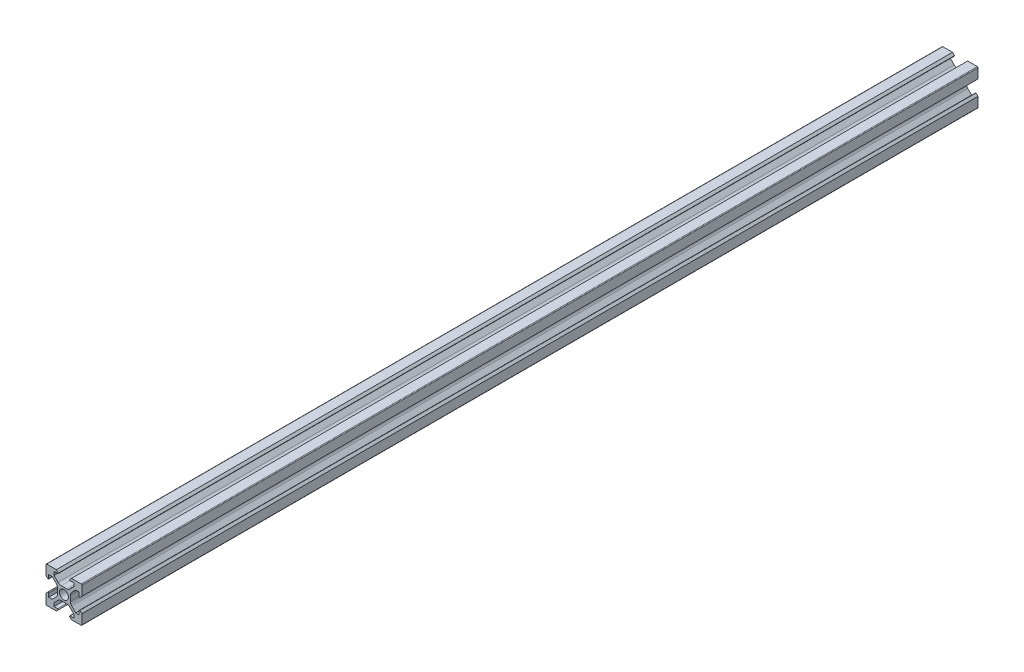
ISO-10303-21;
HEADER;
FILE_DESCRIPTION(('STEP AP214'),'2;1');
FILE_NAME('part.step','',(''),(''),'','','');
FILE_SCHEMA(('AUTOMOTIVE_DESIGN { 1 0 10303 214 1 1 1 1 }'));
ENDSEC;
DATA;
#1=APPLICATION_CONTEXT('core data for automotive mechanical design processes');
#2=APPLICATION_PROTOCOL_DEFINITION('international standard','automotive_design',2000,#1);
#3=PRODUCT_CONTEXT('',#1,'mechanical');
#4=PRODUCT('Part','Part','',(#3));
#5=PRODUCT_RELATED_PRODUCT_CATEGORY('part','',(#4));
#6=PRODUCT_DEFINITION_FORMATION('','',#4);
#7=PRODUCT_DEFINITION_CONTEXT('part definition',#1,'design');
#8=PRODUCT_DEFINITION('design','',#6,#7);
#9=PRODUCT_DEFINITION_SHAPE('','',#8);
#10=(LENGTH_UNIT() NAMED_UNIT(*) SI_UNIT(.MILLI.,.METRE.));
#11=(NAMED_UNIT(*) PLANE_ANGLE_UNIT() SI_UNIT($,.RADIAN.));
#12=(NAMED_UNIT(*) SI_UNIT($,.STERADIAN.) SOLID_ANGLE_UNIT());
#13=UNCERTAINTY_MEASURE_WITH_UNIT(LENGTH_MEASURE(1.E-05),#10,'distance_accuracy_value','');
#14=(GEOMETRIC_REPRESENTATION_CONTEXT(3) GLOBAL_UNCERTAINTY_ASSIGNED_CONTEXT((#13)) GLOBAL_UNIT_ASSIGNED_CONTEXT((#10,
#11,#12)) REPRESENTATION_CONTEXT('',''));
#15=CARTESIAN_POINT('',(0.,0.,0.));
#16=DIRECTION('',(0.,0.,1.));
#17=DIRECTION('',(1.,0.,0.));
#18=AXIS2_PLACEMENT_3D('',#15,#16,#17);
#19=CARTESIAN_POINT('',(-1.50380592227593,6.09999999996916,250.));
#20=DIRECTION('',(0.,0.,1.));
#21=DIRECTION('',(1.,0.,0.));
#22=AXIS2_PLACEMENT_3D('',#19,#20,#21);
#23=PLANE('',#22);
#24=DIRECTION('',(-0.707106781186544,0.707106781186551,0.));
#25=VECTOR('',#24,1.);
#26=CARTESIAN_POINT('',(-5.49999999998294,6.56066017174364,250.));
#27=LINE('',#26,#25);
#28=CARTESIAN_POINT('',(-3.27157287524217,4.33223304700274,250.));
#29=VERTEX_POINT('',#28);
#30=CARTESIAN_POINT('',(-5.49999999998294,6.56066017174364,250.));
#31=VERTEX_POINT('',#30);
#32=EDGE_CURVE('E674',#29,#31,#27,.T.);
#33=ORIENTED_EDGE('',*,*,#32,.T.);
#34=DIRECTION('',(0.,1.,0.));
#35=VECTOR('',#34,1.);
#36=CARTESIAN_POINT('',(-5.49999999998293,8.49999999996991,250.));
#37=LINE('',#36,#35);
#38=CARTESIAN_POINT('',(-5.49999999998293,8.49999999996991,250.));
#39=VERTEX_POINT('',#38);
#40=EDGE_CURVE('E272',#31,#39,#37,.T.);
#41=ORIENTED_EDGE('',*,*,#40,.T.);
#42=DIRECTION('',(1.,0.,0.));
#43=VECTOR('',#42,1.);
#44=CARTESIAN_POINT('',(-5.49999999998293,8.49999999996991,250.));
#45=LINE('',#44,#43);
#46=CARTESIAN_POINT('',(-3.49999999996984,8.4999999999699,250.));
#47=VERTEX_POINT('',#46);
#48=EDGE_CURVE('E919',#39,#47,#45,.T.);
#49=ORIENTED_EDGE('',*,*,#48,.T.);
#50=CARTESIAN_POINT('',(-3.49999999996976,8.8999999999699,250.));
#51=DIRECTION('',(0.,0.,1.));
#52=DIRECTION('',(1.,0.,0.));
#53=AXIS2_PLACEMENT_3D('',#50,#51,#52);
#54=CIRCLE('',#53,0.4);
#55=CARTESIAN_POINT('',(-3.09999999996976,8.8999999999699,250.));
#56=VERTEX_POINT('',#55);
#57=EDGE_CURVE('E939',#47,#56,#54,.T.);
#58=ORIENTED_EDGE('',*,*,#57,.T.);
#59=DIRECTION('',(-0.707106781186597,0.707106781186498,0.));
#60=VECTOR('',#59,1.);
#61=CARTESIAN_POINT('',(-3.09999999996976,8.89999999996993,250.));
#62=LINE('',#61,#60);
#63=CARTESIAN_POINT('',(-4.19999999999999,10.,250.));
#64=VERTEX_POINT('',#63);
#65=EDGE_CURVE('E935',#56,#64,#62,.T.);
#66=ORIENTED_EDGE('',*,*,#65,.T.);
#67=DIRECTION('',(-1.,0.,0.));
#68=VECTOR('',#67,1.);
#69=CARTESIAN_POINT('',(-9.59999999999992,10.0000000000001,250.));
#70=LINE('',#69,#68);
#71=CARTESIAN_POINT('',(-9.59999999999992,10.0000000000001,250.));
#72=VERTEX_POINT('',#71);
#73=EDGE_CURVE('E938',#64,#72,#70,.T.);
#74=ORIENTED_EDGE('',*,*,#73,.T.);
#75=CARTESIAN_POINT('',(-9.59999999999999,9.60000000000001,250.));
#76=DIRECTION('',(0.,0.,1.));
#77=DIRECTION('',(1.,0.,0.));
#78=AXIS2_PLACEMENT_3D('',#75,#76,#77);
#79=CIRCLE('',#78,0.400000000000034);
#80=CARTESIAN_POINT('',(-10.,9.60000000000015,250.));
#81=VERTEX_POINT('',#80);
#82=EDGE_CURVE('E943',#72,#81,#79,.T.);
#83=ORIENTED_EDGE('',*,*,#82,.T.);
#84=DIRECTION('',(0.,-1.,0.));
#85=VECTOR('',#84,1.);
#86=CARTESIAN_POINT('',(-9.99999999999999,9.60000000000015,250.));
#87=LINE('',#86,#85);
#88=CARTESIAN_POINT('',(-9.99999999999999,4.2,250.));
#89=VERTEX_POINT('',#88);
#90=EDGE_CURVE('E950',#81,#89,#87,.T.);
#91=ORIENTED_EDGE('',*,*,#90,.T.);
#92=DIRECTION('',(0.707106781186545,-0.70710678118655,0.));
#93=VECTOR('',#92,1.);
#94=CARTESIAN_POINT('',(-8.89999999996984,3.09999999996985,250.));
#95=LINE('',#94,#93);
#96=CARTESIAN_POINT('',(-8.89999999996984,3.09999999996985,250.));
#97=VERTEX_POINT('',#96);
#98=EDGE_CURVE('E953',#89,#97,#95,.T.);
#99=ORIENTED_EDGE('',*,*,#98,.T.);
#100=CARTESIAN_POINT('',(-8.89999999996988,3.49999999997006,250.));
#101=DIRECTION('',(0.,0.,1.));
#102=DIRECTION('',(-1.,0.,0.));
#103=AXIS2_PLACEMENT_3D('',#100,#101,#102);
#104=CIRCLE('',#103,0.400000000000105);
#105=CARTESIAN_POINT('',(-8.49999999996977,3.49999999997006,250.));
#106=VERTEX_POINT('',#105);
#107=EDGE_CURVE('E956',#97,#106,#104,.T.);
#108=ORIENTED_EDGE('',*,*,#107,.T.);
#109=DIRECTION('',(0.,1.,0.));
#110=VECTOR('',#109,1.);
#111=CARTESIAN_POINT('',(-8.49999999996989,5.49999999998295,250.));
#112=LINE('',#111,#110);
#113=CARTESIAN_POINT('',(-8.49999999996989,5.49999999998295,250.));
#114=VERTEX_POINT('',#113);
#115=EDGE_CURVE('E959',#106,#114,#112,.T.);
#116=ORIENTED_EDGE('',*,*,#115,.T.);
#117=DIRECTION('',(1.,0.,0.));
#118=VECTOR('',#117,1.);
#119=CARTESIAN_POINT('',(-8.49999999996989,5.49999999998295,250.));
#120=LINE('',#119,#118);
#121=CARTESIAN_POINT('',(-6.56066017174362,5.49999999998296,250.));
#122=VERTEX_POINT('',#121);
#123=EDGE_CURVE('E962',#114,#122,#120,.T.);
#124=ORIENTED_EDGE('',*,*,#123,.T.);
#125=DIRECTION('',(0.707106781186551,-0.707106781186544,0.));
#126=VECTOR('',#125,1.);
#127=CARTESIAN_POINT('',(-6.56066017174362,5.49999999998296,250.));
#128=LINE('',#127,#126);
#129=CARTESIAN_POINT('',(-4.33223304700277,3.27157287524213,250.));
#130=VERTEX_POINT('',#129);
#131=EDGE_CURVE('E965',#122,#130,#128,.T.);
#132=ORIENTED_EDGE('',*,*,#131,.T.);
#133=CARTESIAN_POINT('',(-6.09999999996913,1.50380592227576,250.));
#134=DIRECTION('',(0.,0.,-1.));
#135=DIRECTION('',(-1.,0.,0.));
#136=AXIS2_PLACEMENT_3D('',#133,#134,#135);
#137=CIRCLE('',#136,2.5);
#138=CARTESIAN_POINT('',(-3.59999999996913,1.50380592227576,250.));
#139=VERTEX_POINT('',#138);
#140=EDGE_CURVE('E968',#130,#139,#137,.T.);
#141=ORIENTED_EDGE('',*,*,#140,.T.);
#142=DIRECTION('',(0.,-1.,0.));
#143=VECTOR('',#142,1.);
#144=CARTESIAN_POINT('',(-3.59999999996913,1.50380592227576,250.));
#145=LINE('',#144,#143);
#146=CARTESIAN_POINT('',(-3.59999999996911,-1.50380592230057,250.));
#147=VERTEX_POINT('',#146);
#148=EDGE_CURVE('E971',#139,#147,#145,.T.);
#149=ORIENTED_EDGE('',*,*,#148,.T.);
#150=CARTESIAN_POINT('',(-6.09999999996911,-1.50380592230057,250.));
#151=DIRECTION('',(0.,0.,-1.));
#152=DIRECTION('',(1.,0.,0.));
#153=AXIS2_PLACEMENT_3D('',#150,#151,#152);
#154=CIRCLE('',#153,2.50000000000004);
#155=CARTESIAN_POINT('',(-4.33223304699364,-3.2715728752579,250.));
#156=VERTEX_POINT('',#155);
#157=EDGE_CURVE('E974',#147,#156,#154,.T.);
#158=ORIENTED_EDGE('',*,*,#157,.T.);
#159=DIRECTION('',(-0.707106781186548,-0.707106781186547,0.));
#160=VECTOR('',#159,1.);
#161=CARTESIAN_POINT('',(-6.56066017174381,-5.50000000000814,250.));
#162=LINE('',#161,#160);
#163=CARTESIAN_POINT('',(-6.56066017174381,-5.50000000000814,250.));
#164=VERTEX_POINT('',#163);
#165=EDGE_CURVE('E977',#156,#164,#162,.T.);
#166=ORIENTED_EDGE('',*,*,#165,.T.);
#167=DIRECTION('',(-1.,0.,0.));
#168=VECTOR('',#167,1.);
#169=CARTESIAN_POINT('',(-8.49999999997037,-5.50000000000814,250.));
#170=LINE('',#169,#168);
#171=CARTESIAN_POINT('',(-8.49999999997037,-5.50000000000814,250.));
#172=VERTEX_POINT('',#171);
#173=EDGE_CURVE('E980',#164,#172,#170,.T.);
#174=ORIENTED_EDGE('',*,*,#173,.T.);
#175=DIRECTION('',(0.,1.,0.));
#176=VECTOR('',#175,1.);
#177=CARTESIAN_POINT('',(-8.49999999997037,-5.50000000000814,250.));
#178=LINE('',#177,#176);
#179=CARTESIAN_POINT('',(-8.49999999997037,-3.49999999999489,250.));
#180=VERTEX_POINT('',#179);
#181=EDGE_CURVE('E983',#172,#180,#178,.T.);
#182=ORIENTED_EDGE('',*,*,#181,.T.);
#183=CARTESIAN_POINT('',(-8.89999999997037,-3.49999999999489,250.));
#184=DIRECTION('',(0.,0.,1.));
#185=DIRECTION('',(1.,0.,0.));
#186=AXIS2_PLACEMENT_3D('',#183,#184,#185);
#187=CIRCLE('',#186,0.400000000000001);
#188=CARTESIAN_POINT('',(-8.8999999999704,-3.09999999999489,250.));
#189=VERTEX_POINT('',#188);
#190=EDGE_CURVE('E986',#180,#189,#187,.T.);
#191=ORIENTED_EDGE('',*,*,#190,.T.);
#192=DIRECTION('',(-0.707106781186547,-0.707106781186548,0.));
#193=VECTOR('',#192,1.);
#194=CARTESIAN_POINT('',(-8.8999999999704,-3.09999999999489,250.));
#195=LINE('',#194,#193);
#196=CARTESIAN_POINT('',(-10.0000000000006,-4.20000000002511,250.));
#197=VERTEX_POINT('',#196);
#198=EDGE_CURVE('E989',#189,#197,#195,.T.);
#199=ORIENTED_EDGE('',*,*,#198,.T.);
#200=DIRECTION('',(0.,-1.,0.));
#201=VECTOR('',#200,1.);
#202=CARTESIAN_POINT('',(-10.0000000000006,-9.60000000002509,250.));
#203=LINE('',#202,#201);
#204=CARTESIAN_POINT('',(-10.0000000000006,-9.60000000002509,250.));
#205=VERTEX_POINT('',#204);
#206=EDGE_CURVE('E992',#197,#205,#203,.T.);
#207=ORIENTED_EDGE('',*,*,#206,.T.);
#208=CARTESIAN_POINT('',(-9.60000000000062,-9.60000000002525,250.));
#209=DIRECTION('',(0.,0.,1.));
#210=DIRECTION('',(1.,0.,0.));
#211=AXIS2_PLACEMENT_3D('',#208,#209,#210);
#212=CIRCLE('',#211,0.4);
#213=CARTESIAN_POINT('',(-9.60000000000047,-10.0000000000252,250.));
#214=VERTEX_POINT('',#213);
#215=EDGE_CURVE('E995',#205,#214,#212,.T.);
#216=ORIENTED_EDGE('',*,*,#215,.T.);
#217=DIRECTION('',(1.,0.,0.));
#218=VECTOR('',#217,1.);
#219=CARTESIAN_POINT('',(-9.60000000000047,-10.0000000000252,250.));
#220=LINE('',#219,#218);
#221=CARTESIAN_POINT('',(-4.20000000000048,-10.0000000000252,250.));
#222=VERTEX_POINT('',#221);
#223=EDGE_CURVE('E998',#214,#222,#220,.T.);
#224=ORIENTED_EDGE('',*,*,#223,.T.);
#225=DIRECTION('',(0.707106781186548,0.707106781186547,0.));
#226=VECTOR('',#225,1.);
#227=CARTESIAN_POINT('',(-3.09999999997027,-8.89999999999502,250.));
#228=LINE('',#227,#226);
#229=CARTESIAN_POINT('',(-3.09999999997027,-8.89999999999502,250.));
#230=VERTEX_POINT('',#229);
#231=EDGE_CURVE('E1001',#222,#230,#228,.T.);
#232=ORIENTED_EDGE('',*,*,#231,.T.);
#233=CARTESIAN_POINT('',(-3.49999999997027,-8.89999999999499,250.));
#234=DIRECTION('',(0.,0.,1.));
#235=DIRECTION('',(-1.,0.,0.));
#236=AXIS2_PLACEMENT_3D('',#233,#234,#235);
#237=CIRCLE('',#236,0.400000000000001);
#238=CARTESIAN_POINT('',(-3.49999999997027,-8.49999999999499,250.));
#239=VERTEX_POINT('',#238);
#240=EDGE_CURVE('E1004',#230,#239,#237,.T.);
#241=ORIENTED_EDGE('',*,*,#240,.T.);
#242=DIRECTION('',(-1.,0.,0.));
#243=VECTOR('',#242,1.);
#244=CARTESIAN_POINT('',(-5.49999999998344,-8.49999999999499,250.));
#245=LINE('',#244,#243);
#246=CARTESIAN_POINT('',(-5.49999999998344,-8.49999999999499,250.));
#247=VERTEX_POINT('',#246);
#248=EDGE_CURVE('E1007',#239,#247,#245,.T.);
#249=ORIENTED_EDGE('',*,*,#248,.T.);
#250=DIRECTION('',(0.,1.,0.));
#251=VECTOR('',#250,1.);
#252=CARTESIAN_POINT('',(-5.49999999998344,-8.49999999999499,250.));
#253=LINE('',#252,#251);
#254=CARTESIAN_POINT('',(-5.49999999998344,-6.56066017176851,250.));
#255=VERTEX_POINT('',#254);
#256=EDGE_CURVE('E1010',#247,#255,#253,.T.);
#257=ORIENTED_EDGE('',*,*,#256,.T.);
#258=DIRECTION('',(0.707106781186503,0.707106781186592,0.));
#259=VECTOR('',#258,1.);
#260=CARTESIAN_POINT('',(-5.49999999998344,-6.56066017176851,250.));
#261=LINE('',#260,#259);
#262=CARTESIAN_POINT('',(-3.2715728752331,-4.33223304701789,250.));
#263=VERTEX_POINT('',#262);
#264=EDGE_CURVE('E1013',#255,#263,#261,.T.);
#265=ORIENTED_EDGE('',*,*,#264,.T.);
#266=CARTESIAN_POINT('',(-1.50380592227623,-6.09999999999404,250.));
#267=DIRECTION('',(0.,0.,-1.));
#268=DIRECTION('',(-1.,0.,0.));
#269=AXIS2_PLACEMENT_3D('',#266,#267,#268);
#270=CIRCLE('',#269,2.5000000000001);
#271=CARTESIAN_POINT('',(-1.50380592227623,-3.59999999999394,250.));
#272=VERTEX_POINT('',#271);
#273=EDGE_CURVE('E1016',#263,#272,#270,.T.);
#274=ORIENTED_EDGE('',*,*,#273,.T.);
#275=DIRECTION('',(1.,0.,0.));
#276=VECTOR('',#275,1.);
#277=CARTESIAN_POINT('',(-1.50380592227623,-3.59999999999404,250.));
#278=LINE('',#277,#276);
#279=CARTESIAN_POINT('',(1.50380592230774,-3.59999999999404,250.));
#280=VERTEX_POINT('',#279);
#281=EDGE_CURVE('E1019',#272,#280,#278,.T.);
#282=ORIENTED_EDGE('',*,*,#281,.T.);
#283=CARTESIAN_POINT('',(1.50380592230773,-6.09999999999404,250.));
#284=DIRECTION('',(0.,0.,-1.));
#285=DIRECTION('',(1.,0.,0.));
#286=AXIS2_PLACEMENT_3D('',#283,#284,#285);
#287=CIRCLE('',#286,2.5000000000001);
#288=CARTESIAN_POINT('',(3.27157287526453,-4.33223304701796,250.));
#289=VERTEX_POINT('',#288);
#290=EDGE_CURVE('E1022',#280,#289,#287,.T.);
#291=ORIENTED_EDGE('',*,*,#290,.T.);
#292=DIRECTION('',(0.707106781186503,-0.707106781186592,0.));
#293=VECTOR('',#292,1.);
#294=CARTESIAN_POINT('',(5.50000000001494,-6.56066017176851,250.));
#295=LINE('',#294,#293);
#296=CARTESIAN_POINT('',(5.50000000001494,-6.56066017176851,250.));
#297=VERTEX_POINT('',#296);
#298=EDGE_CURVE('E1025',#289,#297,#295,.T.);
#299=ORIENTED_EDGE('',*,*,#298,.T.);
#300=DIRECTION('',(0.,-1.,0.));
#301=VECTOR('',#300,1.);
#302=CARTESIAN_POINT('',(5.50000000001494,-8.49999999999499,250.));
#303=LINE('',#302,#301);
#304=CARTESIAN_POINT('',(5.50000000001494,-8.49999999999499,250.));
#305=VERTEX_POINT('',#304);
#306=EDGE_CURVE('E1028',#297,#305,#303,.T.);
#307=ORIENTED_EDGE('',*,*,#306,.T.);
#308=DIRECTION('',(-1.,0.,0.));
#309=VECTOR('',#308,1.);
#310=CARTESIAN_POINT('',(5.50000000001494,-8.49999999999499,250.));
#311=LINE('',#310,#309);
#312=CARTESIAN_POINT('',(3.50000000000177,-8.49999999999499,250.));
#313=VERTEX_POINT('',#312);
#314=EDGE_CURVE('E1031',#305,#313,#311,.T.);
#315=ORIENTED_EDGE('',*,*,#314,.T.);
#316=CARTESIAN_POINT('',(3.50000000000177,-8.89999999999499,250.));
#317=DIRECTION('',(0.,0.,1.));
#318=DIRECTION('',(1.,0.,0.));
#319=AXIS2_PLACEMENT_3D('',#316,#317,#318);
#320=CIRCLE('',#319,0.400000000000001);
#321=CARTESIAN_POINT('',(3.10000000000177,-8.89999999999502,250.));
#322=VERTEX_POINT('',#321);
#323=EDGE_CURVE('E1034',#313,#322,#320,.T.);
#324=ORIENTED_EDGE('',*,*,#323,.T.);
#325=DIRECTION('',(0.707106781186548,-0.707106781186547,0.));
#326=VECTOR('',#325,1.);
#327=CARTESIAN_POINT('',(3.10000000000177,-8.89999999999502,250.));
#328=LINE('',#327,#326);
#329=CARTESIAN_POINT('',(4.20000000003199,-10.0000000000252,250.));
#330=VERTEX_POINT('',#329);
#331=EDGE_CURVE('E1037',#322,#330,#328,.T.);
#332=ORIENTED_EDGE('',*,*,#331,.T.);
#333=DIRECTION('',(1.,0.,0.));
#334=VECTOR('',#333,1.);
#335=CARTESIAN_POINT('',(9.60000000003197,-10.0000000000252,250.));
#336=LINE('',#335,#334);
#337=CARTESIAN_POINT('',(9.60000000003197,-10.0000000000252,250.));
#338=VERTEX_POINT('',#337);
#339=EDGE_CURVE('E1040',#330,#338,#336,.T.);
#340=ORIENTED_EDGE('',*,*,#339,.T.);
#341=CARTESIAN_POINT('',(9.60000000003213,-9.60000000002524,250.));
#342=DIRECTION('',(0.,0.,1.));
#343=DIRECTION('',(-1.,0.,0.));
#344=AXIS2_PLACEMENT_3D('',#341,#342,#343);
#345=CIRCLE('',#344,0.4);
#346=CARTESIAN_POINT('',(10.0000000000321,-9.60000000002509,250.));
#347=VERTEX_POINT('',#346);
#348=EDGE_CURVE('E1043',#338,#347,#345,.T.);
#349=ORIENTED_EDGE('',*,*,#348,.T.);
#350=DIRECTION('',(0.,1.,0.));
#351=VECTOR('',#350,1.);
#352=CARTESIAN_POINT('',(10.0000000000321,-9.60000000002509,250.));
#353=LINE('',#352,#351);
#354=CARTESIAN_POINT('',(10.0000000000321,-4.20000000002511,250.));
#355=VERTEX_POINT('',#354);
#356=EDGE_CURVE('E1046',#347,#355,#353,.T.);
#357=ORIENTED_EDGE('',*,*,#356,.T.);
#358=DIRECTION('',(-0.707106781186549,0.707106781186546,0.));
#359=VECTOR('',#358,1.);
#360=CARTESIAN_POINT('',(8.9000000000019,-3.09999999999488,250.));
#361=LINE('',#360,#359);
#362=CARTESIAN_POINT('',(8.9000000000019,-3.09999999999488,250.));
#363=VERTEX_POINT('',#362);
#364=EDGE_CURVE('E1049',#355,#363,#361,.T.);
#365=ORIENTED_EDGE('',*,*,#364,.T.);
#366=CARTESIAN_POINT('',(8.90000000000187,-3.49999999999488,250.));
#367=DIRECTION('',(0.,0.,1.));
#368=DIRECTION('',(-1.,0.,0.));
#369=AXIS2_PLACEMENT_3D('',#366,#367,#368);
#370=CIRCLE('',#369,0.400000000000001);
#371=CARTESIAN_POINT('',(8.50000000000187,-3.49999999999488,250.));
#372=VERTEX_POINT('',#371);
#373=EDGE_CURVE('E1052',#363,#372,#370,.T.);
#374=ORIENTED_EDGE('',*,*,#373,.T.);
#375=DIRECTION('',(0.,-1.,0.));
#376=VECTOR('',#375,1.);
#377=CARTESIAN_POINT('',(8.50000000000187,-5.50000000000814,250.));
#378=LINE('',#377,#376);
#379=CARTESIAN_POINT('',(8.50000000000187,-5.50000000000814,250.));
#380=VERTEX_POINT('',#379);
#381=EDGE_CURVE('E1055',#372,#380,#378,.T.);
#382=ORIENTED_EDGE('',*,*,#381,.T.);
#383=DIRECTION('',(-1.,0.,0.));
#384=VECTOR('',#383,1.);
#385=CARTESIAN_POINT('',(8.50000000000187,-5.50000000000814,250.));
#386=LINE('',#385,#384);
#387=CARTESIAN_POINT('',(6.56066017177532,-5.50000000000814,250.));
#388=VERTEX_POINT('',#387);
#389=EDGE_CURVE('E1058',#380,#388,#386,.T.);
#390=ORIENTED_EDGE('',*,*,#389,.T.);
#391=DIRECTION('',(-0.707106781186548,0.707106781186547,0.));
#392=VECTOR('',#391,1.);
#393=CARTESIAN_POINT('',(6.56066017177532,-5.50000000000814,250.));
#394=LINE('',#393,#392);
#395=CARTESIAN_POINT('',(4.33223304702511,-3.27157287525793,250.));
#396=VERTEX_POINT('',#395);
#397=EDGE_CURVE('E1061',#388,#396,#394,.T.);
#398=ORIENTED_EDGE('',*,*,#397,.T.);
#399=CARTESIAN_POINT('',(6.10000000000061,-1.50380592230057,250.));
#400=DIRECTION('',(0.,0.,-1.));
#401=DIRECTION('',(-1.,0.,0.));
#402=AXIS2_PLACEMENT_3D('',#399,#400,#401);
#403=CIRCLE('',#402,2.50000000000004);
#404=CARTESIAN_POINT('',(3.60000000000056,-1.50380592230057,250.));
#405=VERTEX_POINT('',#404);
#406=EDGE_CURVE('E1064',#396,#405,#403,.T.);
#407=ORIENTED_EDGE('',*,*,#406,.T.);
#408=DIRECTION('',(0.,1.,0.));
#409=VECTOR('',#408,1.);
#410=CARTESIAN_POINT('',(3.60000000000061,-1.50380592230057,250.));
#411=LINE('',#410,#409);
#412=CARTESIAN_POINT('',(3.60000000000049,1.50380592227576,250.));
#413=VERTEX_POINT('',#412);
#414=EDGE_CURVE('E1067',#405,#413,#411,.T.);
#415=ORIENTED_EDGE('',*,*,#414,.T.);
#416=CARTESIAN_POINT('',(6.10000000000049,1.50380592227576,250.));
#417=DIRECTION('',(0.,0.,-1.));
#418=DIRECTION('',(1.,0.,0.));
#419=AXIS2_PLACEMENT_3D('',#416,#417,#418);
#420=CIRCLE('',#419,2.5);
#421=CARTESIAN_POINT('',(4.33223304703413,3.27157287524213,250.));
#422=VERTEX_POINT('',#421);
#423=EDGE_CURVE('E1070',#413,#422,#420,.T.);
#424=ORIENTED_EDGE('',*,*,#423,.T.);
#425=DIRECTION('',(0.70710678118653,0.707106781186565,0.));
#426=VECTOR('',#425,1.);
#427=CARTESIAN_POINT('',(6.56066017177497,5.49999999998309,250.));
#428=LINE('',#427,#426);
#429=CARTESIAN_POINT('',(6.56066017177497,5.49999999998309,250.));
#430=VERTEX_POINT('',#429);
#431=EDGE_CURVE('E1073',#422,#430,#428,.T.);
#432=ORIENTED_EDGE('',*,*,#431,.T.);
#433=DIRECTION('',(1.,0.,0.));
#434=VECTOR('',#433,1.);
#435=CARTESIAN_POINT('',(8.50000000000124,5.49999999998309,250.));
#436=LINE('',#435,#434);
#437=CARTESIAN_POINT('',(8.50000000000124,5.49999999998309,250.));
#438=VERTEX_POINT('',#437);
#439=EDGE_CURVE('E1076',#430,#438,#436,.T.);
#440=ORIENTED_EDGE('',*,*,#439,.T.);
#441=DIRECTION('',(0.,-1.,0.));
#442=VECTOR('',#441,1.);
#443=CARTESIAN_POINT('',(8.50000000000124,5.49999999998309,250.));
#444=LINE('',#443,#442);
#445=CARTESIAN_POINT('',(8.50000000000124,3.49999999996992,250.));
#446=VERTEX_POINT('',#445);
#447=EDGE_CURVE('E1079',#438,#446,#444,.T.);
#448=ORIENTED_EDGE('',*,*,#447,.T.);
#449=CARTESIAN_POINT('',(8.90000000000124,3.49999999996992,250.));
#450=DIRECTION('',(0.,0.,1.));
#451=DIRECTION('',(1.,0.,0.));
#452=AXIS2_PLACEMENT_3D('',#449,#450,#451);
#453=CIRCLE('',#452,0.399999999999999);
#454=CARTESIAN_POINT('',(8.90000000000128,3.09999999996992,250.));
#455=VERTEX_POINT('',#454);
#456=EDGE_CURVE('E1082',#446,#455,#453,.T.);
#457=ORIENTED_EDGE('',*,*,#456,.T.);
#458=DIRECTION('',(0.707106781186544,0.707106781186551,0.));
#459=VECTOR('',#458,1.);
#460=CARTESIAN_POINT('',(8.90000000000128,3.09999999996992,250.));
#461=LINE('',#460,#459);
#462=CARTESIAN_POINT('',(10.0000000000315,4.20000000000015,250.));
#463=VERTEX_POINT('',#462);
#464=EDGE_CURVE('E1085',#455,#463,#461,.T.);
#465=ORIENTED_EDGE('',*,*,#464,.T.);
#466=DIRECTION('',(0.,1.,0.));
#467=VECTOR('',#466,1.);
#468=CARTESIAN_POINT('',(10.0000000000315,9.60000000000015,250.));
#469=LINE('',#468,#467);
#470=CARTESIAN_POINT('',(10.0000000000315,9.60000000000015,250.));
#471=VERTEX_POINT('',#470);
#472=EDGE_CURVE('E1088',#463,#471,#469,.T.);
#473=ORIENTED_EDGE('',*,*,#472,.T.);
#474=CARTESIAN_POINT('',(9.60000000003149,9.60000000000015,250.));
#475=DIRECTION('',(0.,0.,1.));
#476=DIRECTION('',(-1.,0.,0.));
#477=AXIS2_PLACEMENT_3D('',#474,#475,#476);
#478=CIRCLE('',#477,0.400000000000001);
#479=CARTESIAN_POINT('',(9.60000000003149,10.0000000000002,250.));
#480=VERTEX_POINT('',#479);
#481=EDGE_CURVE('E1091',#471,#480,#478,.T.);
#482=ORIENTED_EDGE('',*,*,#481,.T.);
#483=DIRECTION('',(-1.,0.,0.));
#484=VECTOR('',#483,1.);
#485=CARTESIAN_POINT('',(9.60000000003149,10.0000000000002,250.));
#486=LINE('',#485,#484);
#487=CARTESIAN_POINT('',(4.20000000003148,10.0000000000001,250.));
#488=VERTEX_POINT('',#487);
#489=EDGE_CURVE('E1094',#480,#488,#486,.T.);
#490=ORIENTED_EDGE('',*,*,#489,.T.);
#491=DIRECTION('',(-0.707106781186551,-0.707106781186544,0.));
#492=VECTOR('',#491,1.);
#493=CARTESIAN_POINT('',(3.10000000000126,8.89999999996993,250.));
#494=LINE('',#493,#492);
#495=CARTESIAN_POINT('',(3.10000000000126,8.89999999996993,250.));
#496=VERTEX_POINT('',#495);
#497=EDGE_CURVE('E1097',#488,#496,#494,.T.);
#498=ORIENTED_EDGE('',*,*,#497,.T.);
#499=CARTESIAN_POINT('',(3.50000000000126,8.89999999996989,250.));
#500=DIRECTION('',(0.,0.,1.));
#501=DIRECTION('',(-1.,0.,0.));
#502=AXIS2_PLACEMENT_3D('',#499,#500,#501);
#503=CIRCLE('',#502,0.4);
#504=CARTESIAN_POINT('',(3.50000000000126,8.4999999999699,250.));
#505=VERTEX_POINT('',#504);
#506=EDGE_CURVE('E1100',#496,#505,#503,.T.);
#507=ORIENTED_EDGE('',*,*,#506,.T.);
#508=DIRECTION('',(1.,0.,0.));
#509=VECTOR('',#508,1.);
#510=CARTESIAN_POINT('',(5.50000000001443,8.4999999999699,250.));
#511=LINE('',#510,#509);
#512=CARTESIAN_POINT('',(5.50000000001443,8.4999999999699,250.));
#513=VERTEX_POINT('',#512);
#514=EDGE_CURVE('E1103',#505,#513,#511,.T.);
#515=ORIENTED_EDGE('',*,*,#514,.T.);
#516=DIRECTION('',(0.,-1.,0.));
#517=VECTOR('',#516,1.);
#518=CARTESIAN_POINT('',(5.50000000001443,8.4999999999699,250.));
#519=LINE('',#518,#517);
#520=CARTESIAN_POINT('',(5.50000000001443,6.56066017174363,250.));
#521=VERTEX_POINT('',#520);
#522=EDGE_CURVE('E1106',#513,#521,#519,.T.);
#523=ORIENTED_EDGE('',*,*,#522,.T.);
#524=DIRECTION('',(-0.707106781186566,-0.707106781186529,0.));
#525=VECTOR('',#524,1.);
#526=CARTESIAN_POINT('',(5.50000000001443,6.56066017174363,250.));
#527=LINE('',#526,#525);
#528=CARTESIAN_POINT('',(3.27157287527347,4.33223304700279,250.));
#529=VERTEX_POINT('',#528);
#530=EDGE_CURVE('E459',#521,#529,#527,.T.);
#531=ORIENTED_EDGE('',*,*,#530,.T.);
#532=CARTESIAN_POINT('',(1.50380592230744,6.0999999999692,250.));
#533=DIRECTION('',(0.,0.,-1.));
#534=DIRECTION('',(-1.,0.,0.));
#535=AXIS2_PLACEMENT_3D('',#532,#533,#534);
#536=CIRCLE('',#535,2.49999999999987);
#537=CARTESIAN_POINT('',(1.50380592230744,3.59999999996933,250.));
#538=VERTEX_POINT('',#537);
#539=EDGE_CURVE('E453',#529,#538,#536,.T.);
#540=ORIENTED_EDGE('',*,*,#539,.T.);
#541=DIRECTION('',(-1.,0.,0.));
#542=VECTOR('',#541,1.);
#543=CARTESIAN_POINT('',(-1.50380592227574,3.59999999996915,250.));
#544=LINE('',#543,#542);
#545=CARTESIAN_POINT('',(-1.50380592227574,3.59999999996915,250.));
#546=VERTEX_POINT('',#545);
#547=EDGE_CURVE('E457',#538,#546,#544,.T.);
#548=ORIENTED_EDGE('',*,*,#547,.T.);
#549=CARTESIAN_POINT('',(-1.50380592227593,6.09999999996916,250.));
#550=DIRECTION('',(0.,0.,-1.));
#551=DIRECTION('',(1.,0.,0.));
#552=AXIS2_PLACEMENT_3D('',#549,#550,#551);
#553=CIRCLE('',#552,2.49999999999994);
#554=EDGE_CURVE('E61',#546,#29,#553,.T.);
#555=ORIENTED_EDGE('',*,*,#554,.T.);
#556=EDGE_LOOP('',(#33,#41,#49,#58,#66,#74,#83,#91,#99,#108,#116,#124,#132,#141,#149,#158,#166,
#174,#182,#191,#199,#207,#216,#224,#232,#241,#249,#257,#265,#274,#282,#291,#299,#307,#315,#324,
#332,#340,#349,#357,#365,#374,#382,#390,#398,#407,#415,#424,#432,#440,#448,#457,#465,#473,#482,
#490,#498,#507,#515,#523,#531,#540,#548,#555));
#557=FACE_BOUND('',#556,.T.);
#558=CARTESIAN_POINT('',(1.57495544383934E-11,-1.55890925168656E-11,250.));
#559=DIRECTION('',(0.,0.,1.));
#560=DIRECTION('',(1.,0.,0.));
#561=AXIS2_PLACEMENT_3D('',#558,#559,#560);
#562=CIRCLE('',#561,2.50000000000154);
#563=CARTESIAN_POINT('',(2.50000000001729,-1.55890925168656E-11,250.));
#564=VERTEX_POINT('',#563);
#565=EDGE_CURVE('E486',#564,#564,#562,.T.);
#566=ORIENTED_EDGE('',*,*,#565,.F.);
#567=EDGE_LOOP('',(#566));
#568=FACE_BOUND('',#567,.T.);
#569=ADVANCED_FACE('F43',(#557,#568),#23,.T.);
#570=CARTESIAN_POINT('',(-1.50380592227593,6.09999999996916,-250.));
#571=DIRECTION('',(0.,0.,1.));
#572=DIRECTION('',(1.,0.,0.));
#573=AXIS2_PLACEMENT_3D('',#570,#571,#572);
#574=PLANE('',#573);
#575=DIRECTION('',(-0.707106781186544,0.707106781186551,0.));
#576=VECTOR('',#575,1.);
#577=CARTESIAN_POINT('',(-5.49999999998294,6.56066017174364,-250.));
#578=LINE('',#577,#576);
#579=CARTESIAN_POINT('',(-3.27157287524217,4.33223304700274,-250.));
#580=VERTEX_POINT('',#579);
#581=CARTESIAN_POINT('',(-5.49999999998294,6.56066017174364,-250.));
#582=VERTEX_POINT('',#581);
#583=EDGE_CURVE('E481',#580,#582,#578,.T.);
#584=ORIENTED_EDGE('',*,*,#583,.F.);
#585=CARTESIAN_POINT('',(-1.50380592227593,6.09999999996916,-250.));
#586=DIRECTION('',(0.,0.,-1.));
#587=DIRECTION('',(1.,0.,0.));
#588=AXIS2_PLACEMENT_3D('',#585,#586,#587);
#589=CIRCLE('',#588,2.49999999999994);
#590=CARTESIAN_POINT('',(-1.50380592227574,3.59999999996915,-250.));
#591=VERTEX_POINT('',#590);
#592=EDGE_CURVE('E264',#591,#580,#589,.T.);
#593=ORIENTED_EDGE('',*,*,#592,.F.);
#594=DIRECTION('',(-1.,0.,0.));
#595=VECTOR('',#594,1.);
#596=CARTESIAN_POINT('',(-1.50380592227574,3.59999999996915,-250.));
#597=LINE('',#596,#595);
#598=CARTESIAN_POINT('',(1.50380592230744,3.59999999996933,-250.));
#599=VERTEX_POINT('',#598);
#600=EDGE_CURVE('E258',#599,#591,#597,.T.);
#601=ORIENTED_EDGE('',*,*,#600,.F.);
#602=CARTESIAN_POINT('',(1.50380592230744,6.0999999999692,-250.));
#603=DIRECTION('',(0.,0.,-1.));
#604=DIRECTION('',(-1.,0.,0.));
#605=AXIS2_PLACEMENT_3D('',#602,#603,#604);
#606=CIRCLE('',#605,2.49999999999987);
#607=CARTESIAN_POINT('',(3.27157287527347,4.33223304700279,-250.));
#608=VERTEX_POINT('',#607);
#609=EDGE_CURVE('E468',#608,#599,#606,.T.);
#610=ORIENTED_EDGE('',*,*,#609,.F.);
#611=DIRECTION('',(-0.707106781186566,-0.707106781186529,0.));
#612=VECTOR('',#611,1.);
#613=CARTESIAN_POINT('',(5.50000000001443,6.56066017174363,-250.));
#614=LINE('',#613,#612);
#615=CARTESIAN_POINT('',(5.50000000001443,6.56066017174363,-250.));
#616=VERTEX_POINT('',#615);
#617=EDGE_CURVE('E665',#616,#608,#614,.T.);
#618=ORIENTED_EDGE('',*,*,#617,.F.);
#619=DIRECTION('',(0.,-1.,0.));
#620=VECTOR('',#619,1.);
#621=CARTESIAN_POINT('',(5.50000000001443,8.4999999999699,-250.));
#622=LINE('',#621,#620);
#623=CARTESIAN_POINT('',(5.50000000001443,8.4999999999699,-250.));
#624=VERTEX_POINT('',#623);
#625=EDGE_CURVE('E662',#624,#616,#622,.T.);
#626=ORIENTED_EDGE('',*,*,#625,.F.);
#627=DIRECTION('',(1.,0.,0.));
#628=VECTOR('',#627,1.);
#629=CARTESIAN_POINT('',(5.50000000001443,8.4999999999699,-250.));
#630=LINE('',#629,#628);
#631=CARTESIAN_POINT('',(3.50000000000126,8.4999999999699,-250.));
#632=VERTEX_POINT('',#631);
#633=EDGE_CURVE('E659',#632,#624,#630,.T.);
#634=ORIENTED_EDGE('',*,*,#633,.F.);
#635=CARTESIAN_POINT('',(3.50000000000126,8.89999999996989,-250.));
#636=DIRECTION('',(0.,0.,1.));
#637=DIRECTION('',(-1.,0.,0.));
#638=AXIS2_PLACEMENT_3D('',#635,#636,#637);
#639=CIRCLE('',#638,0.4);
#640=CARTESIAN_POINT('',(3.10000000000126,8.89999999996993,-250.));
#641=VERTEX_POINT('',#640);
#642=EDGE_CURVE('E656',#641,#632,#639,.T.);
#643=ORIENTED_EDGE('',*,*,#642,.F.);
#644=DIRECTION('',(-0.707106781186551,-0.707106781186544,0.));
#645=VECTOR('',#644,1.);
#646=CARTESIAN_POINT('',(3.10000000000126,8.89999999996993,-250.));
#647=LINE('',#646,#645);
#648=CARTESIAN_POINT('',(4.20000000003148,10.0000000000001,-250.));
#649=VERTEX_POINT('',#648);
#650=EDGE_CURVE('E653',#649,#641,#647,.T.);
#651=ORIENTED_EDGE('',*,*,#650,.F.);
#652=DIRECTION('',(-1.,0.,0.));
#653=VECTOR('',#652,1.);
#654=CARTESIAN_POINT('',(9.60000000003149,10.0000000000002,-250.));
#655=LINE('',#654,#653);
#656=CARTESIAN_POINT('',(9.60000000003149,10.0000000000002,-250.));
#657=VERTEX_POINT('',#656);
#658=EDGE_CURVE('E650',#657,#649,#655,.T.);
#659=ORIENTED_EDGE('',*,*,#658,.F.);
#660=CARTESIAN_POINT('',(9.60000000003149,9.60000000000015,-250.));
#661=DIRECTION('',(0.,0.,1.));
#662=DIRECTION('',(-1.,0.,0.));
#663=AXIS2_PLACEMENT_3D('',#660,#661,#662);
#664=CIRCLE('',#663,0.400000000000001);
#665=CARTESIAN_POINT('',(10.0000000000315,9.60000000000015,-250.));
#666=VERTEX_POINT('',#665);
#667=EDGE_CURVE('E647',#666,#657,#664,.T.);
#668=ORIENTED_EDGE('',*,*,#667,.F.);
#669=DIRECTION('',(0.,1.,0.));
#670=VECTOR('',#669,1.);
#671=CARTESIAN_POINT('',(10.0000000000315,9.60000000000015,-250.));
#672=LINE('',#671,#670);
#673=CARTESIAN_POINT('',(10.0000000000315,4.20000000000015,-250.));
#674=VERTEX_POINT('',#673);
#675=EDGE_CURVE('E644',#674,#666,#672,.T.);
#676=ORIENTED_EDGE('',*,*,#675,.F.);
#677=DIRECTION('',(0.707106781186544,0.707106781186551,0.));
#678=VECTOR('',#677,1.);
#679=CARTESIAN_POINT('',(8.90000000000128,3.09999999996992,-250.));
#680=LINE('',#679,#678);
#681=CARTESIAN_POINT('',(8.90000000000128,3.09999999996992,-250.));
#682=VERTEX_POINT('',#681);
#683=EDGE_CURVE('E641',#682,#674,#680,.T.);
#684=ORIENTED_EDGE('',*,*,#683,.F.);
#685=CARTESIAN_POINT('',(8.90000000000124,3.49999999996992,-250.));
#686=DIRECTION('',(0.,0.,1.));
#687=DIRECTION('',(1.,0.,0.));
#688=AXIS2_PLACEMENT_3D('',#685,#686,#687);
#689=CIRCLE('',#688,0.399999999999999);
#690=CARTESIAN_POINT('',(8.50000000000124,3.49999999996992,-250.));
#691=VERTEX_POINT('',#690);
#692=EDGE_CURVE('E638',#691,#682,#689,.T.);
#693=ORIENTED_EDGE('',*,*,#692,.F.);
#694=DIRECTION('',(0.,-1.,0.));
#695=VECTOR('',#694,1.);
#696=CARTESIAN_POINT('',(8.50000000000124,5.49999999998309,-250.));
#697=LINE('',#696,#695);
#698=CARTESIAN_POINT('',(8.50000000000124,5.49999999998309,-250.));
#699=VERTEX_POINT('',#698);
#700=EDGE_CURVE('E635',#699,#691,#697,.T.);
#701=ORIENTED_EDGE('',*,*,#700,.F.);
#702=DIRECTION('',(1.,0.,0.));
#703=VECTOR('',#702,1.);
#704=CARTESIAN_POINT('',(8.50000000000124,5.49999999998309,-250.));
#705=LINE('',#704,#703);
#706=CARTESIAN_POINT('',(6.56066017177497,5.49999999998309,-250.));
#707=VERTEX_POINT('',#706);
#708=EDGE_CURVE('E632',#707,#699,#705,.T.);
#709=ORIENTED_EDGE('',*,*,#708,.F.);
#710=DIRECTION('',(0.70710678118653,0.707106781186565,0.));
#711=VECTOR('',#710,1.);
#712=CARTESIAN_POINT('',(6.56066017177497,5.49999999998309,-250.));
#713=LINE('',#712,#711);
#714=CARTESIAN_POINT('',(4.33223304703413,3.27157287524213,-250.));
#715=VERTEX_POINT('',#714);
#716=EDGE_CURVE('E629',#715,#707,#713,.T.);
#717=ORIENTED_EDGE('',*,*,#716,.F.);
#718=CARTESIAN_POINT('',(6.10000000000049,1.50380592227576,-250.));
#719=DIRECTION('',(0.,0.,-1.));
#720=DIRECTION('',(1.,0.,0.));
#721=AXIS2_PLACEMENT_3D('',#718,#719,#720);
#722=CIRCLE('',#721,2.5);
#723=CARTESIAN_POINT('',(3.60000000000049,1.50380592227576,-250.));
#724=VERTEX_POINT('',#723);
#725=EDGE_CURVE('E626',#724,#715,#722,.T.);
#726=ORIENTED_EDGE('',*,*,#725,.F.);
#727=DIRECTION('',(0.,1.,0.));
#728=VECTOR('',#727,1.);
#729=CARTESIAN_POINT('',(3.60000000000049,1.50380592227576,-250.));
#730=LINE('',#729,#728);
#731=CARTESIAN_POINT('',(3.60000000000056,-1.50380592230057,-250.));
#732=VERTEX_POINT('',#731);
#733=EDGE_CURVE('E623',#732,#724,#730,.T.);
#734=ORIENTED_EDGE('',*,*,#733,.F.);
#735=CARTESIAN_POINT('',(6.10000000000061,-1.50380592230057,-250.));
#736=DIRECTION('',(0.,0.,-1.));
#737=DIRECTION('',(-1.,0.,0.));
#738=AXIS2_PLACEMENT_3D('',#735,#736,#737);
#739=CIRCLE('',#738,2.50000000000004);
#740=CARTESIAN_POINT('',(4.33223304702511,-3.27157287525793,-250.));
#741=VERTEX_POINT('',#740);
#742=EDGE_CURVE('E619',#741,#732,#739,.T.);
#743=ORIENTED_EDGE('',*,*,#742,.F.);
#744=DIRECTION('',(-0.707106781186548,0.707106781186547,0.));
#745=VECTOR('',#744,1.);
#746=CARTESIAN_POINT('',(6.56066017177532,-5.50000000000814,-250.));
#747=LINE('',#746,#745);
#748=CARTESIAN_POINT('',(6.56066017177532,-5.50000000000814,-250.));
#749=VERTEX_POINT('',#748);
#750=EDGE_CURVE('E616',#749,#741,#747,.T.);
#751=ORIENTED_EDGE('',*,*,#750,.F.);
#752=DIRECTION('',(-1.,0.,0.));
#753=VECTOR('',#752,1.);
#754=CARTESIAN_POINT('',(8.50000000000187,-5.50000000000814,-250.));
#755=LINE('',#754,#753);
#756=CARTESIAN_POINT('',(8.50000000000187,-5.50000000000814,-250.));
#757=VERTEX_POINT('',#756);
#758=EDGE_CURVE('E613',#757,#749,#755,.T.);
#759=ORIENTED_EDGE('',*,*,#758,.F.);
#760=DIRECTION('',(0.,-1.,0.));
#761=VECTOR('',#760,1.);
#762=CARTESIAN_POINT('',(8.50000000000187,-5.50000000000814,-250.));
#763=LINE('',#762,#761);
#764=CARTESIAN_POINT('',(8.50000000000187,-3.49999999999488,-250.));
#765=VERTEX_POINT('',#764);
#766=EDGE_CURVE('E610',#765,#757,#763,.T.);
#767=ORIENTED_EDGE('',*,*,#766,.F.);
#768=CARTESIAN_POINT('',(8.90000000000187,-3.49999999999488,-250.));
#769=DIRECTION('',(0.,0.,1.));
#770=DIRECTION('',(-1.,0.,0.));
#771=AXIS2_PLACEMENT_3D('',#768,#769,#770);
#772=CIRCLE('',#771,0.400000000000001);
#773=CARTESIAN_POINT('',(8.9000000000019,-3.09999999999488,-250.));
#774=VERTEX_POINT('',#773);
#775=EDGE_CURVE('E607',#774,#765,#772,.T.);
#776=ORIENTED_EDGE('',*,*,#775,.F.);
#777=DIRECTION('',(-0.707106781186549,0.707106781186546,0.));
#778=VECTOR('',#777,1.);
#779=CARTESIAN_POINT('',(8.9000000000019,-3.09999999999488,-250.));
#780=LINE('',#779,#778);
#781=CARTESIAN_POINT('',(10.0000000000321,-4.20000000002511,-250.));
#782=VERTEX_POINT('',#781);
#783=EDGE_CURVE('E604',#782,#774,#780,.T.);
#784=ORIENTED_EDGE('',*,*,#783,.F.);
#785=DIRECTION('',(0.,1.,0.));
#786=VECTOR('',#785,1.);
#787=CARTESIAN_POINT('',(10.0000000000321,-9.60000000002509,-250.));
#788=LINE('',#787,#786);
#789=CARTESIAN_POINT('',(10.0000000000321,-9.60000000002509,-250.));
#790=VERTEX_POINT('',#789);
#791=EDGE_CURVE('E601',#790,#782,#788,.T.);
#792=ORIENTED_EDGE('',*,*,#791,.F.);
#793=CARTESIAN_POINT('',(9.60000000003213,-9.60000000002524,-250.));
#794=DIRECTION('',(0.,0.,1.));
#795=DIRECTION('',(-1.,0.,0.));
#796=AXIS2_PLACEMENT_3D('',#793,#794,#795);
#797=CIRCLE('',#796,0.4);
#798=CARTESIAN_POINT('',(9.60000000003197,-10.0000000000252,-250.));
#799=VERTEX_POINT('',#798);
#800=EDGE_CURVE('E598',#799,#790,#797,.T.);
#801=ORIENTED_EDGE('',*,*,#800,.F.);
#802=DIRECTION('',(1.,0.,0.));
#803=VECTOR('',#802,1.);
#804=CARTESIAN_POINT('',(9.60000000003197,-10.0000000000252,-250.));
#805=LINE('',#804,#803);
#806=CARTESIAN_POINT('',(4.20000000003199,-10.0000000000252,-250.));
#807=VERTEX_POINT('',#806);
#808=EDGE_CURVE('E595',#807,#799,#805,.T.);
#809=ORIENTED_EDGE('',*,*,#808,.F.);
#810=DIRECTION('',(0.707106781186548,-0.707106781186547,0.));
#811=VECTOR('',#810,1.);
#812=CARTESIAN_POINT('',(3.10000000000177,-8.89999999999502,-250.));
#813=LINE('',#812,#811);
#814=CARTESIAN_POINT('',(3.10000000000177,-8.89999999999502,-250.));
#815=VERTEX_POINT('',#814);
#816=EDGE_CURVE('E592',#815,#807,#813,.T.);
#817=ORIENTED_EDGE('',*,*,#816,.F.);
#818=CARTESIAN_POINT('',(3.50000000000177,-8.89999999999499,-250.));
#819=DIRECTION('',(0.,0.,1.));
#820=DIRECTION('',(1.,0.,0.));
#821=AXIS2_PLACEMENT_3D('',#818,#819,#820);
#822=CIRCLE('',#821,0.400000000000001);
#823=CARTESIAN_POINT('',(3.50000000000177,-8.49999999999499,-250.));
#824=VERTEX_POINT('',#823);
#825=EDGE_CURVE('E589',#824,#815,#822,.T.);
#826=ORIENTED_EDGE('',*,*,#825,.F.);
#827=DIRECTION('',(-1.,0.,0.));
#828=VECTOR('',#827,1.);
#829=CARTESIAN_POINT('',(5.50000000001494,-8.49999999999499,-250.));
#830=LINE('',#829,#828);
#831=CARTESIAN_POINT('',(5.50000000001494,-8.49999999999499,-250.));
#832=VERTEX_POINT('',#831);
#833=EDGE_CURVE('E586',#832,#824,#830,.T.);
#834=ORIENTED_EDGE('',*,*,#833,.F.);
#835=DIRECTION('',(0.,-1.,0.));
#836=VECTOR('',#835,1.);
#837=CARTESIAN_POINT('',(5.50000000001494,-8.49999999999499,-250.));
#838=LINE('',#837,#836);
#839=CARTESIAN_POINT('',(5.50000000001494,-6.56066017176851,-250.));
#840=VERTEX_POINT('',#839);
#841=EDGE_CURVE('E583',#840,#832,#838,.T.);
#842=ORIENTED_EDGE('',*,*,#841,.F.);
#843=DIRECTION('',(0.707106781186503,-0.707106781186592,0.));
#844=VECTOR('',#843,1.);
#845=CARTESIAN_POINT('',(5.50000000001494,-6.56066017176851,-250.));
#846=LINE('',#845,#844);
#847=CARTESIAN_POINT('',(3.27157287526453,-4.33223304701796,-250.));
#848=VERTEX_POINT('',#847);
#849=EDGE_CURVE('E580',#848,#840,#846,.T.);
#850=ORIENTED_EDGE('',*,*,#849,.F.);
#851=CARTESIAN_POINT('',(1.50380592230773,-6.09999999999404,-250.));
#852=DIRECTION('',(0.,0.,-1.));
#853=DIRECTION('',(1.,0.,0.));
#854=AXIS2_PLACEMENT_3D('',#851,#852,#853);
#855=CIRCLE('',#854,2.5000000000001);
#856=CARTESIAN_POINT('',(1.50380592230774,-3.59999999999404,-250.));
#857=VERTEX_POINT('',#856);
#858=EDGE_CURVE('E577',#857,#848,#855,.T.);
#859=ORIENTED_EDGE('',*,*,#858,.F.);
#860=DIRECTION('',(1.,0.,0.));
#861=VECTOR('',#860,1.);
#862=CARTESIAN_POINT('',(-1.50380592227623,-3.59999999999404,-250.));
#863=LINE('',#862,#861);
#864=CARTESIAN_POINT('',(-1.50380592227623,-3.59999999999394,-250.));
#865=VERTEX_POINT('',#864);
#866=EDGE_CURVE('E574',#865,#857,#863,.T.);
#867=ORIENTED_EDGE('',*,*,#866,.F.);
#868=CARTESIAN_POINT('',(-1.50380592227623,-6.09999999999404,-250.));
#869=DIRECTION('',(0.,0.,-1.));
#870=DIRECTION('',(-1.,0.,0.));
#871=AXIS2_PLACEMENT_3D('',#868,#869,#870);
#872=CIRCLE('',#871,2.5000000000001);
#873=CARTESIAN_POINT('',(-3.2715728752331,-4.33223304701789,-250.));
#874=VERTEX_POINT('',#873);
#875=EDGE_CURVE('E571',#874,#865,#872,.T.);
#876=ORIENTED_EDGE('',*,*,#875,.F.);
#877=DIRECTION('',(0.707106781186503,0.707106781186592,0.));
#878=VECTOR('',#877,1.);
#879=CARTESIAN_POINT('',(-5.49999999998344,-6.56066017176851,-250.));
#880=LINE('',#879,#878);
#881=CARTESIAN_POINT('',(-5.49999999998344,-6.56066017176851,-250.));
#882=VERTEX_POINT('',#881);
#883=EDGE_CURVE('E568',#882,#874,#880,.T.);
#884=ORIENTED_EDGE('',*,*,#883,.F.);
#885=DIRECTION('',(0.,1.,0.));
#886=VECTOR('',#885,1.);
#887=CARTESIAN_POINT('',(-5.49999999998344,-8.49999999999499,-250.));
#888=LINE('',#887,#886);
#889=CARTESIAN_POINT('',(-5.49999999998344,-8.49999999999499,-250.));
#890=VERTEX_POINT('',#889);
#891=EDGE_CURVE('E565',#890,#882,#888,.T.);
#892=ORIENTED_EDGE('',*,*,#891,.F.);
#893=DIRECTION('',(-1.,0.,0.));
#894=VECTOR('',#893,1.);
#895=CARTESIAN_POINT('',(-5.49999999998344,-8.49999999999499,-250.));
#896=LINE('',#895,#894);
#897=CARTESIAN_POINT('',(-3.49999999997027,-8.49999999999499,-250.));
#898=VERTEX_POINT('',#897);
#899=EDGE_CURVE('E562',#898,#890,#896,.T.);
#900=ORIENTED_EDGE('',*,*,#899,.F.);
#901=CARTESIAN_POINT('',(-3.49999999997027,-8.89999999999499,-250.));
#902=DIRECTION('',(0.,0.,1.));
#903=DIRECTION('',(-1.,0.,0.));
#904=AXIS2_PLACEMENT_3D('',#901,#902,#903);
#905=CIRCLE('',#904,0.400000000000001);
#906=CARTESIAN_POINT('',(-3.09999999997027,-8.89999999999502,-250.));
#907=VERTEX_POINT('',#906);
#908=EDGE_CURVE('E559',#907,#898,#905,.T.);
#909=ORIENTED_EDGE('',*,*,#908,.F.);
#910=DIRECTION('',(0.707106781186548,0.707106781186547,0.));
#911=VECTOR('',#910,1.);
#912=CARTESIAN_POINT('',(-3.09999999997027,-8.89999999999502,-250.));
#913=LINE('',#912,#911);
#914=CARTESIAN_POINT('',(-4.20000000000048,-10.0000000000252,-250.));
#915=VERTEX_POINT('',#914);
#916=EDGE_CURVE('E556',#915,#907,#913,.T.);
#917=ORIENTED_EDGE('',*,*,#916,.F.);
#918=DIRECTION('',(1.,0.,0.));
#919=VECTOR('',#918,1.);
#920=CARTESIAN_POINT('',(-9.60000000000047,-10.0000000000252,-250.));
#921=LINE('',#920,#919);
#922=CARTESIAN_POINT('',(-9.60000000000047,-10.0000000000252,-250.));
#923=VERTEX_POINT('',#922);
#924=EDGE_CURVE('E553',#923,#915,#921,.T.);
#925=ORIENTED_EDGE('',*,*,#924,.F.);
#926=CARTESIAN_POINT('',(-9.60000000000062,-9.60000000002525,-250.));
#927=DIRECTION('',(0.,0.,1.));
#928=DIRECTION('',(1.,0.,0.));
#929=AXIS2_PLACEMENT_3D('',#926,#927,#928);
#930=CIRCLE('',#929,0.4);
#931=CARTESIAN_POINT('',(-10.0000000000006,-9.60000000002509,-250.));
#932=VERTEX_POINT('',#931);
#933=EDGE_CURVE('E550',#932,#923,#930,.T.);
#934=ORIENTED_EDGE('',*,*,#933,.F.);
#935=DIRECTION('',(0.,-1.,0.));
#936=VECTOR('',#935,1.);
#937=CARTESIAN_POINT('',(-10.0000000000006,-9.60000000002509,-250.));
#938=LINE('',#937,#936);
#939=CARTESIAN_POINT('',(-10.0000000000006,-4.20000000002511,-250.));
#940=VERTEX_POINT('',#939);
#941=EDGE_CURVE('E547',#940,#932,#938,.T.);
#942=ORIENTED_EDGE('',*,*,#941,.F.);
#943=DIRECTION('',(-0.707106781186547,-0.707106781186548,0.));
#944=VECTOR('',#943,1.);
#945=CARTESIAN_POINT('',(-8.8999999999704,-3.09999999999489,-250.));
#946=LINE('',#945,#944);
#947=CARTESIAN_POINT('',(-8.8999999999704,-3.09999999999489,-250.));
#948=VERTEX_POINT('',#947);
#949=EDGE_CURVE('E544',#948,#940,#946,.T.);
#950=ORIENTED_EDGE('',*,*,#949,.F.);
#951=CARTESIAN_POINT('',(-8.89999999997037,-3.49999999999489,-250.));
#952=DIRECTION('',(0.,0.,1.));
#953=DIRECTION('',(1.,0.,0.));
#954=AXIS2_PLACEMENT_3D('',#951,#952,#953);
#955=CIRCLE('',#954,0.400000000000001);
#956=CARTESIAN_POINT('',(-8.49999999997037,-3.49999999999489,-250.));
#957=VERTEX_POINT('',#956);
#958=EDGE_CURVE('E541',#957,#948,#955,.T.);
#959=ORIENTED_EDGE('',*,*,#958,.F.);
#960=DIRECTION('',(0.,1.,0.));
#961=VECTOR('',#960,1.);
#962=CARTESIAN_POINT('',(-8.49999999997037,-5.50000000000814,-250.));
#963=LINE('',#962,#961);
#964=CARTESIAN_POINT('',(-8.49999999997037,-5.50000000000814,-250.));
#965=VERTEX_POINT('',#964);
#966=EDGE_CURVE('E538',#965,#957,#963,.T.);
#967=ORIENTED_EDGE('',*,*,#966,.F.);
#968=DIRECTION('',(-1.,0.,0.));
#969=VECTOR('',#968,1.);
#970=CARTESIAN_POINT('',(-8.49999999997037,-5.50000000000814,-250.));
#971=LINE('',#970,#969);
#972=CARTESIAN_POINT('',(-6.56066017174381,-5.50000000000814,-250.));
#973=VERTEX_POINT('',#972);
#974=EDGE_CURVE('E535',#973,#965,#971,.T.);
#975=ORIENTED_EDGE('',*,*,#974,.F.);
#976=DIRECTION('',(-0.707106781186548,-0.707106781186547,0.));
#977=VECTOR('',#976,1.);
#978=CARTESIAN_POINT('',(-6.56066017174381,-5.50000000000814,-250.));
#979=LINE('',#978,#977);
#980=CARTESIAN_POINT('',(-4.33223304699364,-3.2715728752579,-250.));
#981=VERTEX_POINT('',#980);
#982=EDGE_CURVE('E532',#981,#973,#979,.T.);
#983=ORIENTED_EDGE('',*,*,#982,.F.);
#984=CARTESIAN_POINT('',(-6.09999999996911,-1.50380592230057,-250.));
#985=DIRECTION('',(0.,0.,-1.));
#986=DIRECTION('',(1.,0.,0.));
#987=AXIS2_PLACEMENT_3D('',#984,#985,#986);
#988=CIRCLE('',#987,2.50000000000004);
#989=CARTESIAN_POINT('',(-3.59999999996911,-1.50380592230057,-250.));
#990=VERTEX_POINT('',#989);
#991=EDGE_CURVE('E529',#990,#981,#988,.T.);
#992=ORIENTED_EDGE('',*,*,#991,.F.);
#993=DIRECTION('',(0.,-1.,0.));
#994=VECTOR('',#993,1.);
#995=CARTESIAN_POINT('',(-3.59999999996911,-1.50380592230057,-250.));
#996=LINE('',#995,#994);
#997=CARTESIAN_POINT('',(-3.59999999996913,1.50380592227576,-250.));
#998=VERTEX_POINT('',#997);
#999=EDGE_CURVE('E526',#998,#990,#996,.T.);
#1000=ORIENTED_EDGE('',*,*,#999,.F.);
#1001=CARTESIAN_POINT('',(-6.09999999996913,1.50380592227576,-250.));
#1002=DIRECTION('',(0.,0.,-1.));
#1003=DIRECTION('',(-1.,0.,0.));
#1004=AXIS2_PLACEMENT_3D('',#1001,#1002,#1003);
#1005=CIRCLE('',#1004,2.5);
#1006=CARTESIAN_POINT('',(-4.33223304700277,3.27157287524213,-250.));
#1007=VERTEX_POINT('',#1006);
#1008=EDGE_CURVE('E522',#1007,#998,#1005,.T.);
#1009=ORIENTED_EDGE('',*,*,#1008,.F.);
#1010=DIRECTION('',(0.707106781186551,-0.707106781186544,0.));
#1011=VECTOR('',#1010,1.);
#1012=CARTESIAN_POINT('',(-6.56066017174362,5.49999999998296,-250.));
#1013=LINE('',#1012,#1011);
#1014=CARTESIAN_POINT('',(-6.56066017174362,5.49999999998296,-250.));
#1015=VERTEX_POINT('',#1014);
#1016=EDGE_CURVE('E519',#1015,#1007,#1013,.T.);
#1017=ORIENTED_EDGE('',*,*,#1016,.F.);
#1018=DIRECTION('',(1.,0.,0.));
#1019=VECTOR('',#1018,1.);
#1020=CARTESIAN_POINT('',(-8.49999999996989,5.49999999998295,-250.));
#1021=LINE('',#1020,#1019);
#1022=CARTESIAN_POINT('',(-8.49999999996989,5.49999999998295,-250.));
#1023=VERTEX_POINT('',#1022);
#1024=EDGE_CURVE('E516',#1023,#1015,#1021,.T.);
#1025=ORIENTED_EDGE('',*,*,#1024,.F.);
#1026=DIRECTION('',(0.,1.,0.));
#1027=VECTOR('',#1026,1.);
#1028=CARTESIAN_POINT('',(-8.49999999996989,5.49999999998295,-250.));
#1029=LINE('',#1028,#1027);
#1030=CARTESIAN_POINT('',(-8.49999999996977,3.49999999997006,-250.));
#1031=VERTEX_POINT('',#1030);
#1032=EDGE_CURVE('E513',#1031,#1023,#1029,.T.);
#1033=ORIENTED_EDGE('',*,*,#1032,.F.);
#1034=CARTESIAN_POINT('',(-8.89999999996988,3.49999999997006,-250.));
#1035=DIRECTION('',(0.,0.,1.));
#1036=DIRECTION('',(-1.,0.,0.));
#1037=AXIS2_PLACEMENT_3D('',#1034,#1035,#1036);
#1038=CIRCLE('',#1037,0.400000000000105);
#1039=CARTESIAN_POINT('',(-8.89999999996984,3.09999999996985,-250.));
#1040=VERTEX_POINT('',#1039);
#1041=EDGE_CURVE('E510',#1040,#1031,#1038,.T.);
#1042=ORIENTED_EDGE('',*,*,#1041,.F.);
#1043=DIRECTION('',(0.707106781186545,-0.70710678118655,0.));
#1044=VECTOR('',#1043,1.);
#1045=CARTESIAN_POINT('',(-8.89999999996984,3.09999999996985,-250.));
#1046=LINE('',#1045,#1044);
#1047=CARTESIAN_POINT('',(-9.99999999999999,4.2,-250.));
#1048=VERTEX_POINT('',#1047);
#1049=EDGE_CURVE('E507',#1048,#1040,#1046,.T.);
#1050=ORIENTED_EDGE('',*,*,#1049,.F.);
#1051=DIRECTION('',(0.,-1.,0.));
#1052=VECTOR('',#1051,1.);
#1053=CARTESIAN_POINT('',(-9.99999999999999,9.60000000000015,-250.));
#1054=LINE('',#1053,#1052);
#1055=CARTESIAN_POINT('',(-10.,9.60000000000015,-250.));
#1056=VERTEX_POINT('',#1055);
#1057=EDGE_CURVE('E504',#1056,#1048,#1054,.T.);
#1058=ORIENTED_EDGE('',*,*,#1057,.F.);
#1059=CARTESIAN_POINT('',(-9.59999999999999,9.60000000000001,-250.));
#1060=DIRECTION('',(0.,0.,1.));
#1061=DIRECTION('',(1.,0.,0.));
#1062=AXIS2_PLACEMENT_3D('',#1059,#1060,#1061);
#1063=CIRCLE('',#1062,0.400000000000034);
#1064=CARTESIAN_POINT('',(-9.59999999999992,10.0000000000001,-250.));
#1065=VERTEX_POINT('',#1064);
#1066=EDGE_CURVE('E501',#1065,#1056,#1063,.T.);
#1067=ORIENTED_EDGE('',*,*,#1066,.F.);
#1068=DIRECTION('',(-1.,0.,0.));
#1069=VECTOR('',#1068,1.);
#1070=CARTESIAN_POINT('',(-9.59999999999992,10.0000000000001,-250.));
#1071=LINE('',#1070,#1069);
#1072=CARTESIAN_POINT('',(-4.19999999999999,10.,-250.));
#1073=VERTEX_POINT('',#1072);
#1074=EDGE_CURVE('E498',#1073,#1065,#1071,.T.);
#1075=ORIENTED_EDGE('',*,*,#1074,.F.);
#1076=DIRECTION('',(-0.707106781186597,0.707106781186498,0.));
#1077=VECTOR('',#1076,1.);
#1078=CARTESIAN_POINT('',(-3.09999999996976,8.89999999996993,-250.));
#1079=LINE('',#1078,#1077);
#1080=CARTESIAN_POINT('',(-3.09999999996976,8.8999999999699,-250.));
#1081=VERTEX_POINT('',#1080);
#1082=EDGE_CURVE('E495',#1081,#1073,#1079,.T.);
#1083=ORIENTED_EDGE('',*,*,#1082,.F.);
#1084=CARTESIAN_POINT('',(-3.49999999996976,8.8999999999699,-250.));
#1085=DIRECTION('',(0.,0.,1.));
#1086=DIRECTION('',(1.,0.,0.));
#1087=AXIS2_PLACEMENT_3D('',#1084,#1085,#1086);
#1088=CIRCLE('',#1087,0.4);
#1089=CARTESIAN_POINT('',(-3.49999999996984,8.4999999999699,-250.));
#1090=VERTEX_POINT('',#1089);
#1091=EDGE_CURVE('E492',#1090,#1081,#1088,.T.);
#1092=ORIENTED_EDGE('',*,*,#1091,.F.);
#1093=DIRECTION('',(1.,0.,0.));
#1094=VECTOR('',#1093,1.);
#1095=CARTESIAN_POINT('',(-5.49999999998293,8.49999999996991,-250.));
#1096=LINE('',#1095,#1094);
#1097=CARTESIAN_POINT('',(-5.49999999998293,8.49999999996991,-250.));
#1098=VERTEX_POINT('',#1097);
#1099=EDGE_CURVE('E489',#1098,#1090,#1096,.T.);
#1100=ORIENTED_EDGE('',*,*,#1099,.F.);
#1101=DIRECTION('',(0.,1.,0.));
#1102=VECTOR('',#1101,1.);
#1103=CARTESIAN_POINT('',(-5.49999999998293,8.49999999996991,-250.));
#1104=LINE('',#1103,#1102);
#1105=EDGE_CURVE('E485',#582,#1098,#1104,.T.);
#1106=ORIENTED_EDGE('',*,*,#1105,.F.);
#1107=EDGE_LOOP('',(#584,#593,#601,#610,#618,#626,#634,#643,#651,#659,#668,#676,#684,#693,#701,
#709,#717,#726,#734,#743,#751,#759,#767,#776,#784,#792,#801,#809,#817,#826,#834,#842,#850,#859,
#867,#876,#884,#892,#900,#909,#917,#925,#934,#942,#950,#959,#967,#975,#983,#992,#1000,#1009,
#1017,#1025,#1033,#1042,#1050,#1058,#1067,#1075,#1083,#1092,#1100,#1106));
#1108=FACE_BOUND('',#1107,.T.);
#1109=CARTESIAN_POINT('',(1.57495544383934E-11,-1.55890925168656E-11,-250.));
#1110=DIRECTION('',(0.,0.,1.));
#1111=DIRECTION('',(1.,0.,0.));
#1112=AXIS2_PLACEMENT_3D('',#1109,#1110,#1111);
#1113=CIRCLE('',#1112,2.50000000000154);
#1114=CARTESIAN_POINT('',(2.50000000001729,-1.55890925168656E-11,-250.));
#1115=VERTEX_POINT('',#1114);
#1116=EDGE_CURVE('E2070',#1115,#1115,#1113,.T.);
#1117=ORIENTED_EDGE('',*,*,#1116,.T.);
#1118=EDGE_LOOP('',(#1117));
#1119=FACE_BOUND('',#1118,.T.);
#1120=ADVANCED_FACE('F923',(#1108,#1119),#574,.F.);
#1121=CARTESIAN_POINT('',(-5.49999999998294,6.56066017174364,250.));
#1122=DIRECTION('',(-0.707106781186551,-0.707106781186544,0.));
#1123=DIRECTION('',(0.707106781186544,-0.707106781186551,0.));
#1124=AXIS2_PLACEMENT_3D('',#1121,#1122,#1123);
#1125=PLANE('',#1124);
#1126=ORIENTED_EDGE('',*,*,#583,.T.);
#1127=DIRECTION('',(0.,0.,-1.));
#1128=VECTOR('',#1127,1.);
#1129=CARTESIAN_POINT('',(-5.49999999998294,6.56066017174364,250.));
#1130=LINE('',#1129,#1128);
#1131=EDGE_CURVE('E11',#31,#582,#1130,.T.);
#1132=ORIENTED_EDGE('',*,*,#1131,.F.);
#1133=ORIENTED_EDGE('',*,*,#32,.F.);
#1134=DIRECTION('',(0.,0.,-1.));
#1135=VECTOR('',#1134,1.);
#1136=CARTESIAN_POINT('',(-3.27157287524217,4.33223304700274,250.));
#1137=LINE('',#1136,#1135);
#1138=EDGE_CURVE('E477',#29,#580,#1137,.T.);
#1139=ORIENTED_EDGE('',*,*,#1138,.T.);
#1140=EDGE_LOOP('',(#1126,#1132,#1133,#1139));
#1141=FACE_BOUND('',#1140,.T.);
#1142=ADVANCED_FACE('F45',(#1141),#1125,.F.);
#1143=CARTESIAN_POINT('',(-5.49999999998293,8.49999999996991,250.));
#1144=DIRECTION('',(-1.,0.,0.));
#1145=DIRECTION('',(0.,-1.,0.));
#1146=AXIS2_PLACEMENT_3D('',#1143,#1144,#1145);
#1147=PLANE('',#1146);
#1148=ORIENTED_EDGE('',*,*,#1105,.T.);
#1149=DIRECTION('',(0.,0.,-1.));
#1150=VECTOR('',#1149,1.);
#1151=CARTESIAN_POINT('',(-5.49999999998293,8.49999999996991,250.));
#1152=LINE('',#1151,#1150);
#1153=EDGE_CURVE('E53',#39,#1098,#1152,.T.);
#1154=ORIENTED_EDGE('',*,*,#1153,.F.);
#1155=ORIENTED_EDGE('',*,*,#40,.F.);
#1156=ORIENTED_EDGE('',*,*,#1131,.T.);
#1157=EDGE_LOOP('',(#1148,#1154,#1155,#1156));
#1158=FACE_BOUND('',#1157,.T.);
#1159=ADVANCED_FACE('F1142',(#1158),#1147,.F.);
#1160=CARTESIAN_POINT('',(-5.49999999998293,8.49999999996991,250.));
#1161=DIRECTION('',(0.,1.,0.));
#1162=DIRECTION('',(-1.,0.,0.));
#1163=AXIS2_PLACEMENT_3D('',#1160,#1161,#1162);
#1164=PLANE('',#1163);
#1165=ORIENTED_EDGE('',*,*,#1099,.T.);
#1166=DIRECTION('',(0.,0.,-1.));
#1167=VECTOR('',#1166,1.);
#1168=CARTESIAN_POINT('',(-3.49999999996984,8.4999999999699,250.));
#1169=LINE('',#1168,#1167);
#1170=EDGE_CURVE('E909',#47,#1090,#1169,.T.);
#1171=ORIENTED_EDGE('',*,*,#1170,.F.);
#1172=ORIENTED_EDGE('',*,*,#48,.F.);
#1173=ORIENTED_EDGE('',*,*,#1153,.T.);
#1174=EDGE_LOOP('',(#1165,#1171,#1172,#1173));
#1175=FACE_BOUND('',#1174,.T.);
#1176=ADVANCED_FACE('F917',(#1175),#1164,.F.);
#1177=CARTESIAN_POINT('',(-3.49999999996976,8.8999999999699,250.));
#1178=DIRECTION('',(0.,0.,-1.));
#1179=DIRECTION('',(-1.,0.,0.));
#1180=AXIS2_PLACEMENT_3D('',#1177,#1178,#1179);
#1181=CYLINDRICAL_SURFACE('',#1180,0.4);
#1182=ORIENTED_EDGE('',*,*,#1091,.T.);
#1183=DIRECTION('',(0.,0.,-1.));
#1184=VECTOR('',#1183,1.);
#1185=CARTESIAN_POINT('',(-3.09999999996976,8.8999999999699,250.));
#1186=LINE('',#1185,#1184);
#1187=EDGE_CURVE('E905',#56,#1081,#1186,.T.);
#1188=ORIENTED_EDGE('',*,*,#1187,.F.);
#1189=ORIENTED_EDGE('',*,*,#57,.F.);
#1190=ORIENTED_EDGE('',*,*,#1170,.T.);
#1191=EDGE_LOOP('',(#1182,#1188,#1189,#1190));
#1192=FACE_BOUND('',#1191,.T.);
#1193=ADVANCED_FACE('F929',(#1192),#1181,.T.);
#1194=CARTESIAN_POINT('',(-3.09999999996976,8.89999999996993,250.));
#1195=DIRECTION('',(-0.707106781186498,-0.707106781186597,0.));
#1196=DIRECTION('',(0.707106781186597,-0.707106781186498,0.));
#1197=AXIS2_PLACEMENT_3D('',#1194,#1195,#1196);
#1198=PLANE('',#1197);
#1199=ORIENTED_EDGE('',*,*,#1082,.T.);
#1200=DIRECTION('',(0.,0.,-1.));
#1201=VECTOR('',#1200,1.);
#1202=CARTESIAN_POINT('',(-4.19999999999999,10.,250.));
#1203=LINE('',#1202,#1201);
#1204=EDGE_CURVE('E901',#64,#1073,#1203,.T.);
#1205=ORIENTED_EDGE('',*,*,#1204,.F.);
#1206=ORIENTED_EDGE('',*,*,#65,.F.);
#1207=ORIENTED_EDGE('',*,*,#1187,.T.);
#1208=EDGE_LOOP('',(#1199,#1205,#1206,#1207));
#1209=FACE_BOUND('',#1208,.T.);
#1210=ADVANCED_FACE('F933',(#1209),#1198,.F.);
#1211=CARTESIAN_POINT('',(-9.59999999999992,10.0000000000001,250.));
#1212=DIRECTION('',(0.,-1.,0.));
#1213=DIRECTION('',(1.,0.,0.));
#1214=AXIS2_PLACEMENT_3D('',#1211,#1212,#1213);
#1215=PLANE('',#1214);
#1216=ORIENTED_EDGE('',*,*,#1074,.T.);
#1217=DIRECTION('',(0.,0.,-1.));
#1218=VECTOR('',#1217,1.);
#1219=CARTESIAN_POINT('',(-9.59999999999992,10.0000000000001,250.));
#1220=LINE('',#1219,#1218);
#1221=EDGE_CURVE('E897',#72,#1065,#1220,.T.);
#1222=ORIENTED_EDGE('',*,*,#1221,.F.);
#1223=ORIENTED_EDGE('',*,*,#73,.F.);
#1224=ORIENTED_EDGE('',*,*,#1204,.T.);
#1225=EDGE_LOOP('',(#1216,#1222,#1223,#1224));
#1226=FACE_BOUND('',#1225,.T.);
#1227=ADVANCED_FACE('F1155',(#1226),#1215,.F.);
#1228=CARTESIAN_POINT('',(-9.59999999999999,9.60000000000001,250.));
#1229=DIRECTION('',(0.,0.,-1.));
#1230=DIRECTION('',(-1.,0.,0.));
#1231=AXIS2_PLACEMENT_3D('',#1228,#1229,#1230);
#1232=CYLINDRICAL_SURFACE('',#1231,0.400000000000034);
#1233=ORIENTED_EDGE('',*,*,#1066,.T.);
#1234=DIRECTION('',(0.,0.,-1.));
#1235=VECTOR('',#1234,1.);
#1236=CARTESIAN_POINT('',(-10.,9.60000000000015,250.));
#1237=LINE('',#1236,#1235);
#1238=EDGE_CURVE('E893',#81,#1056,#1237,.T.);
#1239=ORIENTED_EDGE('',*,*,#1238,.F.);
#1240=ORIENTED_EDGE('',*,*,#82,.F.);
#1241=ORIENTED_EDGE('',*,*,#1221,.T.);
#1242=EDGE_LOOP('',(#1233,#1239,#1240,#1241));
#1243=FACE_BOUND('',#1242,.T.);
#1244=ADVANCED_FACE('F1158',(#1243),#1232,.T.);
#1245=CARTESIAN_POINT('',(-9.99999999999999,9.60000000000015,250.));
#1246=DIRECTION('',(1.,0.,0.));
#1247=DIRECTION('',(0.,0.,-1.));
#1248=AXIS2_PLACEMENT_3D('',#1245,#1246,#1247);
#1249=PLANE('',#1248);
#1250=ORIENTED_EDGE('',*,*,#1057,.T.);
#1251=DIRECTION('',(0.,0.,-1.));
#1252=VECTOR('',#1251,1.);
#1253=CARTESIAN_POINT('',(-9.99999999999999,4.2,250.));
#1254=LINE('',#1253,#1252);
#1255=EDGE_CURVE('E889',#89,#1048,#1254,.T.);
#1256=ORIENTED_EDGE('',*,*,#1255,.F.);
#1257=ORIENTED_EDGE('',*,*,#90,.F.);
#1258=ORIENTED_EDGE('',*,*,#1238,.T.);
#1259=EDGE_LOOP('',(#1250,#1256,#1257,#1258));
#1260=FACE_BOUND('',#1259,.T.);
#1261=ADVANCED_FACE('F1162',(#1260),#1249,.F.);
#1262=CARTESIAN_POINT('',(-8.89999999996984,3.09999999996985,250.));
#1263=DIRECTION('',(0.70710678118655,0.707106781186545,0.));
#1264=DIRECTION('',(-0.707106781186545,0.70710678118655,0.));
#1265=AXIS2_PLACEMENT_3D('',#1262,#1263,#1264);
#1266=PLANE('',#1265);
#1267=ORIENTED_EDGE('',*,*,#1049,.T.);
#1268=DIRECTION('',(0.,0.,-1.));
#1269=VECTOR('',#1268,1.);
#1270=CARTESIAN_POINT('',(-8.89999999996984,3.09999999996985,250.));
#1271=LINE('',#1270,#1269);
#1272=EDGE_CURVE('E885',#97,#1040,#1271,.T.);
#1273=ORIENTED_EDGE('',*,*,#1272,.F.);
#1274=ORIENTED_EDGE('',*,*,#98,.F.);
#1275=ORIENTED_EDGE('',*,*,#1255,.T.);
#1276=EDGE_LOOP('',(#1267,#1273,#1274,#1275));
#1277=FACE_BOUND('',#1276,.T.);
#1278=ADVANCED_FACE('F1166',(#1277),#1266,.F.);
#1279=CARTESIAN_POINT('',(-8.89999999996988,3.49999999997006,250.));
#1280=DIRECTION('',(0.,0.,-1.));
#1281=DIRECTION('',(-1.,0.,0.));
#1282=AXIS2_PLACEMENT_3D('',#1279,#1280,#1281);
#1283=CYLINDRICAL_SURFACE('',#1282,0.400000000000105);
#1284=ORIENTED_EDGE('',*,*,#1041,.T.);
#1285=DIRECTION('',(0.,0.,-1.));
#1286=VECTOR('',#1285,1.);
#1287=CARTESIAN_POINT('',(-8.49999999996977,3.49999999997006,250.));
#1288=LINE('',#1287,#1286);
#1289=EDGE_CURVE('E881',#106,#1031,#1288,.T.);
#1290=ORIENTED_EDGE('',*,*,#1289,.F.);
#1291=ORIENTED_EDGE('',*,*,#107,.F.);
#1292=ORIENTED_EDGE('',*,*,#1272,.T.);
#1293=EDGE_LOOP('',(#1284,#1290,#1291,#1292));
#1294=FACE_BOUND('',#1293,.T.);
#1295=ADVANCED_FACE('F1170',(#1294),#1283,.T.);
#1296=CARTESIAN_POINT('',(-8.49999999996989,5.49999999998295,250.));
#1297=DIRECTION('',(-1.,0.,0.));
#1298=DIRECTION('',(0.,-1.,0.));
#1299=AXIS2_PLACEMENT_3D('',#1296,#1297,#1298);
#1300=PLANE('',#1299);
#1301=ORIENTED_EDGE('',*,*,#1032,.T.);
#1302=DIRECTION('',(0.,0.,-1.));
#1303=VECTOR('',#1302,1.);
#1304=CARTESIAN_POINT('',(-8.49999999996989,5.49999999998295,250.));
#1305=LINE('',#1304,#1303);
#1306=EDGE_CURVE('E877',#114,#1023,#1305,.T.);
#1307=ORIENTED_EDGE('',*,*,#1306,.F.);
#1308=ORIENTED_EDGE('',*,*,#115,.F.);
#1309=ORIENTED_EDGE('',*,*,#1289,.T.);
#1310=EDGE_LOOP('',(#1301,#1307,#1308,#1309));
#1311=FACE_BOUND('',#1310,.T.);
#1312=ADVANCED_FACE('F1174',(#1311),#1300,.F.);
#1313=CARTESIAN_POINT('',(-8.49999999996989,5.49999999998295,250.));
#1314=DIRECTION('',(0.,1.,0.));
#1315=DIRECTION('',(-1.,0.,0.));
#1316=AXIS2_PLACEMENT_3D('',#1313,#1314,#1315);
#1317=PLANE('',#1316);
#1318=ORIENTED_EDGE('',*,*,#1024,.T.);
#1319=DIRECTION('',(0.,0.,-1.));
#1320=VECTOR('',#1319,1.);
#1321=CARTESIAN_POINT('',(-6.56066017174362,5.49999999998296,250.));
#1322=LINE('',#1321,#1320);
#1323=EDGE_CURVE('E873',#122,#1015,#1322,.T.);
#1324=ORIENTED_EDGE('',*,*,#1323,.F.);
#1325=ORIENTED_EDGE('',*,*,#123,.F.);
#1326=ORIENTED_EDGE('',*,*,#1306,.T.);
#1327=EDGE_LOOP('',(#1318,#1324,#1325,#1326));
#1328=FACE_BOUND('',#1327,.T.);
#1329=ADVANCED_FACE('F1178',(#1328),#1317,.F.);
#1330=CARTESIAN_POINT('',(-6.56066017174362,5.49999999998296,250.));
#1331=DIRECTION('',(0.707106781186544,0.707106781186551,0.));
#1332=DIRECTION('',(-0.707106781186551,0.707106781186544,0.));
#1333=AXIS2_PLACEMENT_3D('',#1330,#1331,#1332);
#1334=PLANE('',#1333);
#1335=ORIENTED_EDGE('',*,*,#1016,.T.);
#1336=DIRECTION('',(0.,0.,-1.));
#1337=VECTOR('',#1336,1.);
#1338=CARTESIAN_POINT('',(-4.33223304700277,3.27157287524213,250.));
#1339=LINE('',#1338,#1337);
#1340=EDGE_CURVE('E869',#130,#1007,#1339,.T.);
#1341=ORIENTED_EDGE('',*,*,#1340,.F.);
#1342=ORIENTED_EDGE('',*,*,#131,.F.);
#1343=ORIENTED_EDGE('',*,*,#1323,.T.);
#1344=EDGE_LOOP('',(#1335,#1341,#1342,#1343));
#1345=FACE_BOUND('',#1344,.T.);
#1346=ADVANCED_FACE('F1182',(#1345),#1334,.F.);
#1347=CARTESIAN_POINT('',(-6.09999999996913,1.50380592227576,250.));
#1348=DIRECTION('',(0.,0.,-1.));
#1349=DIRECTION('',(-1.,0.,0.));
#1350=AXIS2_PLACEMENT_3D('',#1347,#1348,#1349);
#1351=CYLINDRICAL_SURFACE('',#1350,2.5);
#1352=ORIENTED_EDGE('',*,*,#1008,.T.);
#1353=DIRECTION('',(0.,0.,-1.));
#1354=VECTOR('',#1353,1.);
#1355=CARTESIAN_POINT('',(-3.59999999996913,1.50380592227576,250.));
#1356=LINE('',#1355,#1354);
#1357=EDGE_CURVE('E865',#139,#998,#1356,.T.);
#1358=ORIENTED_EDGE('',*,*,#1357,.F.);
#1359=ORIENTED_EDGE('',*,*,#140,.F.);
#1360=ORIENTED_EDGE('',*,*,#1340,.T.);
#1361=EDGE_LOOP('',(#1352,#1358,#1359,#1360));
#1362=FACE_BOUND('',#1361,.T.);
#1363=ADVANCED_FACE('F1186',(#1362),#1351,.F.);
#1364=CARTESIAN_POINT('',(-3.59999999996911,-1.50380592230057,250.));
#1365=DIRECTION('',(1.,0.,0.));
#1366=DIRECTION('',(0.,0.,-1.));
#1367=AXIS2_PLACEMENT_3D('',#1364,#1365,#1366);
#1368=PLANE('',#1367);
#1369=ORIENTED_EDGE('',*,*,#999,.T.);
#1370=DIRECTION('',(0.,0.,-1.));
#1371=VECTOR('',#1370,1.);
#1372=CARTESIAN_POINT('',(-3.59999999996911,-1.50380592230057,250.));
#1373=LINE('',#1372,#1371);
#1374=EDGE_CURVE('E861',#147,#990,#1373,.T.);
#1375=ORIENTED_EDGE('',*,*,#1374,.F.);
#1376=ORIENTED_EDGE('',*,*,#148,.F.);
#1377=ORIENTED_EDGE('',*,*,#1357,.T.);
#1378=EDGE_LOOP('',(#1369,#1375,#1376,#1377));
#1379=FACE_BOUND('',#1378,.T.);
#1380=ADVANCED_FACE('F1190',(#1379),#1368,.F.);
#1381=CARTESIAN_POINT('',(-6.09999999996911,-1.50380592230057,250.));
#1382=DIRECTION('',(0.,0.,-1.));
#1383=DIRECTION('',(-1.,0.,0.));
#1384=AXIS2_PLACEMENT_3D('',#1381,#1382,#1383);
#1385=CYLINDRICAL_SURFACE('',#1384,2.50000000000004);
#1386=ORIENTED_EDGE('',*,*,#991,.T.);
#1387=DIRECTION('',(0.,0.,-1.));
#1388=VECTOR('',#1387,1.);
#1389=CARTESIAN_POINT('',(-4.33223304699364,-3.2715728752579,250.));
#1390=LINE('',#1389,#1388);
#1391=EDGE_CURVE('E857',#156,#981,#1390,.T.);
#1392=ORIENTED_EDGE('',*,*,#1391,.F.);
#1393=ORIENTED_EDGE('',*,*,#157,.F.);
#1394=ORIENTED_EDGE('',*,*,#1374,.T.);
#1395=EDGE_LOOP('',(#1386,#1392,#1393,#1394));
#1396=FACE_BOUND('',#1395,.T.);
#1397=ADVANCED_FACE('F1194',(#1396),#1385,.F.);
#1398=CARTESIAN_POINT('',(-6.56066017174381,-5.50000000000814,250.));
#1399=DIRECTION('',(0.707106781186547,-0.707106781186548,0.));
#1400=DIRECTION('',(0.707106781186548,0.707106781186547,0.));
#1401=AXIS2_PLACEMENT_3D('',#1398,#1399,#1400);
#1402=PLANE('',#1401);
#1403=ORIENTED_EDGE('',*,*,#982,.T.);
#1404=DIRECTION('',(0.,0.,-1.));
#1405=VECTOR('',#1404,1.);
#1406=CARTESIAN_POINT('',(-6.56066017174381,-5.50000000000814,250.));
#1407=LINE('',#1406,#1405);
#1408=EDGE_CURVE('E853',#164,#973,#1407,.T.);
#1409=ORIENTED_EDGE('',*,*,#1408,.F.);
#1410=ORIENTED_EDGE('',*,*,#165,.F.);
#1411=ORIENTED_EDGE('',*,*,#1391,.T.);
#1412=EDGE_LOOP('',(#1403,#1409,#1410,#1411));
#1413=FACE_BOUND('',#1412,.T.);
#1414=ADVANCED_FACE('F1198',(#1413),#1402,.F.);
#1415=CARTESIAN_POINT('',(-8.49999999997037,-5.50000000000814,250.));
#1416=DIRECTION('',(0.,-1.,0.));
#1417=DIRECTION('',(0.,0.,-1.));
#1418=AXIS2_PLACEMENT_3D('',#1415,#1416,#1417);
#1419=PLANE('',#1418);
#1420=ORIENTED_EDGE('',*,*,#974,.T.);
#1421=DIRECTION('',(0.,0.,-1.));
#1422=VECTOR('',#1421,1.);
#1423=CARTESIAN_POINT('',(-8.49999999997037,-5.50000000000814,250.));
#1424=LINE('',#1423,#1422);
#1425=EDGE_CURVE('E849',#172,#965,#1424,.T.);
#1426=ORIENTED_EDGE('',*,*,#1425,.F.);
#1427=ORIENTED_EDGE('',*,*,#173,.F.);
#1428=ORIENTED_EDGE('',*,*,#1408,.T.);
#1429=EDGE_LOOP('',(#1420,#1426,#1427,#1428));
#1430=FACE_BOUND('',#1429,.T.);
#1431=ADVANCED_FACE('F1202',(#1430),#1419,.F.);
#1432=CARTESIAN_POINT('',(-8.49999999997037,-5.50000000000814,250.));
#1433=DIRECTION('',(-1.,0.,0.));
#1434=DIRECTION('',(0.,0.,1.));
#1435=AXIS2_PLACEMENT_3D('',#1432,#1433,#1434);
#1436=PLANE('',#1435);
#1437=ORIENTED_EDGE('',*,*,#966,.T.);
#1438=DIRECTION('',(0.,0.,-1.));
#1439=VECTOR('',#1438,1.);
#1440=CARTESIAN_POINT('',(-8.49999999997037,-3.49999999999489,250.));
#1441=LINE('',#1440,#1439);
#1442=EDGE_CURVE('E845',#180,#957,#1441,.T.);
#1443=ORIENTED_EDGE('',*,*,#1442,.F.);
#1444=ORIENTED_EDGE('',*,*,#181,.F.);
#1445=ORIENTED_EDGE('',*,*,#1425,.T.);
#1446=EDGE_LOOP('',(#1437,#1443,#1444,#1445));
#1447=FACE_BOUND('',#1446,.T.);
#1448=ADVANCED_FACE('F1206',(#1447),#1436,.F.);
#1449=CARTESIAN_POINT('',(-8.89999999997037,-3.49999999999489,250.));
#1450=DIRECTION('',(0.,0.,-1.));
#1451=DIRECTION('',(-1.,0.,0.));
#1452=AXIS2_PLACEMENT_3D('',#1449,#1450,#1451);
#1453=CYLINDRICAL_SURFACE('',#1452,0.400000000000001);
#1454=ORIENTED_EDGE('',*,*,#958,.T.);
#1455=DIRECTION('',(0.,0.,-1.));
#1456=VECTOR('',#1455,1.);
#1457=CARTESIAN_POINT('',(-8.8999999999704,-3.09999999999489,250.));
#1458=LINE('',#1457,#1456);
#1459=EDGE_CURVE('E841',#189,#948,#1458,.T.);
#1460=ORIENTED_EDGE('',*,*,#1459,.F.);
#1461=ORIENTED_EDGE('',*,*,#190,.F.);
#1462=ORIENTED_EDGE('',*,*,#1442,.T.);
#1463=EDGE_LOOP('',(#1454,#1460,#1461,#1462));
#1464=FACE_BOUND('',#1463,.T.);
#1465=ADVANCED_FACE('F1210',(#1464),#1453,.T.);
#1466=CARTESIAN_POINT('',(-8.8999999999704,-3.09999999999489,250.));
#1467=DIRECTION('',(0.707106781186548,-0.707106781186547,0.));
#1468=DIRECTION('',(0.707106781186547,0.707106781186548,0.));
#1469=AXIS2_PLACEMENT_3D('',#1466,#1467,#1468);
#1470=PLANE('',#1469);
#1471=ORIENTED_EDGE('',*,*,#949,.T.);
#1472=DIRECTION('',(0.,0.,-1.));
#1473=VECTOR('',#1472,1.);
#1474=CARTESIAN_POINT('',(-10.0000000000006,-4.20000000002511,250.));
#1475=LINE('',#1474,#1473);
#1476=EDGE_CURVE('E837',#197,#940,#1475,.T.);
#1477=ORIENTED_EDGE('',*,*,#1476,.F.);
#1478=ORIENTED_EDGE('',*,*,#198,.F.);
#1479=ORIENTED_EDGE('',*,*,#1459,.T.);
#1480=EDGE_LOOP('',(#1471,#1477,#1478,#1479));
#1481=FACE_BOUND('',#1480,.T.);
#1482=ADVANCED_FACE('F1214',(#1481),#1470,.F.);
#1483=CARTESIAN_POINT('',(-10.0000000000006,-9.60000000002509,250.));
#1484=DIRECTION('',(1.,0.,0.));
#1485=DIRECTION('',(0.,0.,-1.));
#1486=AXIS2_PLACEMENT_3D('',#1483,#1484,#1485);
#1487=PLANE('',#1486);
#1488=ORIENTED_EDGE('',*,*,#941,.T.);
#1489=DIRECTION('',(0.,0.,-1.));
#1490=VECTOR('',#1489,1.);
#1491=CARTESIAN_POINT('',(-10.0000000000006,-9.60000000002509,250.));
#1492=LINE('',#1491,#1490);
#1493=EDGE_CURVE('E833',#205,#932,#1492,.T.);
#1494=ORIENTED_EDGE('',*,*,#1493,.F.);
#1495=ORIENTED_EDGE('',*,*,#206,.F.);
#1496=ORIENTED_EDGE('',*,*,#1476,.T.);
#1497=EDGE_LOOP('',(#1488,#1494,#1495,#1496));
#1498=FACE_BOUND('',#1497,.T.);
#1499=ADVANCED_FACE('F1218',(#1498),#1487,.F.);
#1500=CARTESIAN_POINT('',(-9.60000000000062,-9.60000000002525,250.));
#1501=DIRECTION('',(0.,0.,-1.));
#1502=DIRECTION('',(-1.,0.,0.));
#1503=AXIS2_PLACEMENT_3D('',#1500,#1501,#1502);
#1504=CYLINDRICAL_SURFACE('',#1503,0.4);
#1505=ORIENTED_EDGE('',*,*,#933,.T.);
#1506=DIRECTION('',(0.,0.,-1.));
#1507=VECTOR('',#1506,1.);
#1508=CARTESIAN_POINT('',(-9.60000000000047,-10.0000000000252,250.));
#1509=LINE('',#1508,#1507);
#1510=EDGE_CURVE('E829',#214,#923,#1509,.T.);
#1511=ORIENTED_EDGE('',*,*,#1510,.F.);
#1512=ORIENTED_EDGE('',*,*,#215,.F.);
#1513=ORIENTED_EDGE('',*,*,#1493,.T.);
#1514=EDGE_LOOP('',(#1505,#1511,#1512,#1513));
#1515=FACE_BOUND('',#1514,.T.);
#1516=ADVANCED_FACE('F1222',(#1515),#1504,.T.);
#1517=CARTESIAN_POINT('',(-9.60000000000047,-10.0000000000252,250.));
#1518=DIRECTION('',(0.,1.,0.));
#1519=DIRECTION('',(0.,0.,1.));
#1520=AXIS2_PLACEMENT_3D('',#1517,#1518,#1519);
#1521=PLANE('',#1520);
#1522=ORIENTED_EDGE('',*,*,#924,.T.);
#1523=DIRECTION('',(0.,0.,-1.));
#1524=VECTOR('',#1523,1.);
#1525=CARTESIAN_POINT('',(-4.20000000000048,-10.0000000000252,250.));
#1526=LINE('',#1525,#1524);
#1527=EDGE_CURVE('E825',#222,#915,#1526,.T.);
#1528=ORIENTED_EDGE('',*,*,#1527,.F.);
#1529=ORIENTED_EDGE('',*,*,#223,.F.);
#1530=ORIENTED_EDGE('',*,*,#1510,.T.);
#1531=EDGE_LOOP('',(#1522,#1528,#1529,#1530));
#1532=FACE_BOUND('',#1531,.T.);
#1533=ADVANCED_FACE('F1226',(#1532),#1521,.F.);
#1534=CARTESIAN_POINT('',(-3.09999999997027,-8.89999999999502,250.));
#1535=DIRECTION('',(-0.707106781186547,0.707106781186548,0.));
#1536=DIRECTION('',(-0.707106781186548,-0.707106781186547,0.));
#1537=AXIS2_PLACEMENT_3D('',#1534,#1535,#1536);
#1538=PLANE('',#1537);
#1539=ORIENTED_EDGE('',*,*,#916,.T.);
#1540=DIRECTION('',(0.,0.,-1.));
#1541=VECTOR('',#1540,1.);
#1542=CARTESIAN_POINT('',(-3.09999999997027,-8.89999999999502,250.));
#1543=LINE('',#1542,#1541);
#1544=EDGE_CURVE('E821',#230,#907,#1543,.T.);
#1545=ORIENTED_EDGE('',*,*,#1544,.F.);
#1546=ORIENTED_EDGE('',*,*,#231,.F.);
#1547=ORIENTED_EDGE('',*,*,#1527,.T.);
#1548=EDGE_LOOP('',(#1539,#1545,#1546,#1547));
#1549=FACE_BOUND('',#1548,.T.);
#1550=ADVANCED_FACE('F1230',(#1549),#1538,.F.);
#1551=CARTESIAN_POINT('',(-3.49999999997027,-8.89999999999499,250.));
#1552=DIRECTION('',(0.,0.,-1.));
#1553=DIRECTION('',(-1.,0.,0.));
#1554=AXIS2_PLACEMENT_3D('',#1551,#1552,#1553);
#1555=CYLINDRICAL_SURFACE('',#1554,0.400000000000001);
#1556=ORIENTED_EDGE('',*,*,#908,.T.);
#1557=DIRECTION('',(0.,0.,-1.));
#1558=VECTOR('',#1557,1.);
#1559=CARTESIAN_POINT('',(-3.49999999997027,-8.49999999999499,250.));
#1560=LINE('',#1559,#1558);
#1561=EDGE_CURVE('E817',#239,#898,#1560,.T.);
#1562=ORIENTED_EDGE('',*,*,#1561,.F.);
#1563=ORIENTED_EDGE('',*,*,#240,.F.);
#1564=ORIENTED_EDGE('',*,*,#1544,.T.);
#1565=EDGE_LOOP('',(#1556,#1562,#1563,#1564));
#1566=FACE_BOUND('',#1565,.T.);
#1567=ADVANCED_FACE('F1234',(#1566),#1555,.T.);
#1568=CARTESIAN_POINT('',(-5.49999999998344,-8.49999999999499,250.));
#1569=DIRECTION('',(0.,-1.,0.));
#1570=DIRECTION('',(0.,0.,-1.));
#1571=AXIS2_PLACEMENT_3D('',#1568,#1569,#1570);
#1572=PLANE('',#1571);
#1573=ORIENTED_EDGE('',*,*,#899,.T.);
#1574=DIRECTION('',(0.,0.,-1.));
#1575=VECTOR('',#1574,1.);
#1576=CARTESIAN_POINT('',(-5.49999999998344,-8.49999999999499,250.));
#1577=LINE('',#1576,#1575);
#1578=EDGE_CURVE('E813',#247,#890,#1577,.T.);
#1579=ORIENTED_EDGE('',*,*,#1578,.F.);
#1580=ORIENTED_EDGE('',*,*,#248,.F.);
#1581=ORIENTED_EDGE('',*,*,#1561,.T.);
#1582=EDGE_LOOP('',(#1573,#1579,#1580,#1581));
#1583=FACE_BOUND('',#1582,.T.);
#1584=ADVANCED_FACE('F1238',(#1583),#1572,.F.);
#1585=CARTESIAN_POINT('',(-5.49999999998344,-8.49999999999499,250.));
#1586=DIRECTION('',(-1.,0.,0.));
#1587=DIRECTION('',(0.,0.,1.));
#1588=AXIS2_PLACEMENT_3D('',#1585,#1586,#1587);
#1589=PLANE('',#1588);
#1590=ORIENTED_EDGE('',*,*,#891,.T.);
#1591=DIRECTION('',(0.,0.,-1.));
#1592=VECTOR('',#1591,1.);
#1593=CARTESIAN_POINT('',(-5.49999999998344,-6.56066017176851,250.));
#1594=LINE('',#1593,#1592);
#1595=EDGE_CURVE('E809',#255,#882,#1594,.T.);
#1596=ORIENTED_EDGE('',*,*,#1595,.F.);
#1597=ORIENTED_EDGE('',*,*,#256,.F.);
#1598=ORIENTED_EDGE('',*,*,#1578,.T.);
#1599=EDGE_LOOP('',(#1590,#1596,#1597,#1598));
#1600=FACE_BOUND('',#1599,.T.);
#1601=ADVANCED_FACE('F1242',(#1600),#1589,.F.);
#1602=CARTESIAN_POINT('',(-5.49999999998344,-6.56066017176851,250.));
#1603=DIRECTION('',(-0.707106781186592,0.707106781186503,0.));
#1604=DIRECTION('',(-0.707106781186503,-0.707106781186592,0.));
#1605=AXIS2_PLACEMENT_3D('',#1602,#1603,#1604);
#1606=PLANE('',#1605);
#1607=ORIENTED_EDGE('',*,*,#883,.T.);
#1608=DIRECTION('',(0.,0.,-1.));
#1609=VECTOR('',#1608,1.);
#1610=CARTESIAN_POINT('',(-3.2715728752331,-4.33223304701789,250.));
#1611=LINE('',#1610,#1609);
#1612=EDGE_CURVE('E805',#263,#874,#1611,.T.);
#1613=ORIENTED_EDGE('',*,*,#1612,.F.);
#1614=ORIENTED_EDGE('',*,*,#264,.F.);
#1615=ORIENTED_EDGE('',*,*,#1595,.T.);
#1616=EDGE_LOOP('',(#1607,#1613,#1614,#1615));
#1617=FACE_BOUND('',#1616,.T.);
#1618=ADVANCED_FACE('F1246',(#1617),#1606,.F.);
#1619=CARTESIAN_POINT('',(-1.50380592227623,-6.09999999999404,250.));
#1620=DIRECTION('',(0.,0.,-1.));
#1621=DIRECTION('',(-1.,0.,0.));
#1622=AXIS2_PLACEMENT_3D('',#1619,#1620,#1621);
#1623=CYLINDRICAL_SURFACE('',#1622,2.5000000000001);
#1624=ORIENTED_EDGE('',*,*,#875,.T.);
#1625=DIRECTION('',(0.,0.,-1.));
#1626=VECTOR('',#1625,1.);
#1627=CARTESIAN_POINT('',(-1.50380592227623,-3.59999999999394,250.));
#1628=LINE('',#1627,#1626);
#1629=EDGE_CURVE('E801',#272,#865,#1628,.T.);
#1630=ORIENTED_EDGE('',*,*,#1629,.F.);
#1631=ORIENTED_EDGE('',*,*,#273,.F.);
#1632=ORIENTED_EDGE('',*,*,#1612,.T.);
#1633=EDGE_LOOP('',(#1624,#1630,#1631,#1632));
#1634=FACE_BOUND('',#1633,.T.);
#1635=ADVANCED_FACE('F1250',(#1634),#1623,.F.);
#1636=CARTESIAN_POINT('',(-1.50380592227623,-3.59999999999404,250.));
#1637=DIRECTION('',(0.,1.,0.));
#1638=DIRECTION('',(-1.,0.,0.));
#1639=AXIS2_PLACEMENT_3D('',#1636,#1637,#1638);
#1640=PLANE('',#1639);
#1641=ORIENTED_EDGE('',*,*,#866,.T.);
#1642=DIRECTION('',(0.,0.,-1.));
#1643=VECTOR('',#1642,1.);
#1644=CARTESIAN_POINT('',(1.50380592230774,-3.59999999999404,250.));
#1645=LINE('',#1644,#1643);
#1646=EDGE_CURVE('E797',#280,#857,#1645,.T.);
#1647=ORIENTED_EDGE('',*,*,#1646,.F.);
#1648=ORIENTED_EDGE('',*,*,#281,.F.);
#1649=ORIENTED_EDGE('',*,*,#1629,.T.);
#1650=EDGE_LOOP('',(#1641,#1647,#1648,#1649));
#1651=FACE_BOUND('',#1650,.T.);
#1652=ADVANCED_FACE('F1254',(#1651),#1640,.F.);
#1653=CARTESIAN_POINT('',(1.50380592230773,-6.09999999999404,250.));
#1654=DIRECTION('',(0.,0.,-1.));
#1655=DIRECTION('',(-1.,0.,0.));
#1656=AXIS2_PLACEMENT_3D('',#1653,#1654,#1655);
#1657=CYLINDRICAL_SURFACE('',#1656,2.5000000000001);
#1658=ORIENTED_EDGE('',*,*,#858,.T.);
#1659=DIRECTION('',(0.,0.,-1.));
#1660=VECTOR('',#1659,1.);
#1661=CARTESIAN_POINT('',(3.27157287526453,-4.33223304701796,250.));
#1662=LINE('',#1661,#1660);
#1663=EDGE_CURVE('E793',#289,#848,#1662,.T.);
#1664=ORIENTED_EDGE('',*,*,#1663,.F.);
#1665=ORIENTED_EDGE('',*,*,#290,.F.);
#1666=ORIENTED_EDGE('',*,*,#1646,.T.);
#1667=EDGE_LOOP('',(#1658,#1664,#1665,#1666));
#1668=FACE_BOUND('',#1667,.T.);
#1669=ADVANCED_FACE('F1258',(#1668),#1657,.F.);
#1670=CARTESIAN_POINT('',(5.50000000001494,-6.56066017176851,250.));
#1671=DIRECTION('',(0.707106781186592,0.707106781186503,0.));
#1672=DIRECTION('',(-0.707106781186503,0.707106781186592,0.));
#1673=AXIS2_PLACEMENT_3D('',#1670,#1671,#1672);
#1674=PLANE('',#1673);
#1675=ORIENTED_EDGE('',*,*,#849,.T.);
#1676=DIRECTION('',(0.,0.,-1.));
#1677=VECTOR('',#1676,1.);
#1678=CARTESIAN_POINT('',(5.50000000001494,-6.56066017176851,250.));
#1679=LINE('',#1678,#1677);
#1680=EDGE_CURVE('E789',#297,#840,#1679,.T.);
#1681=ORIENTED_EDGE('',*,*,#1680,.F.);
#1682=ORIENTED_EDGE('',*,*,#298,.F.);
#1683=ORIENTED_EDGE('',*,*,#1663,.T.);
#1684=EDGE_LOOP('',(#1675,#1681,#1682,#1683));
#1685=FACE_BOUND('',#1684,.T.);
#1686=ADVANCED_FACE('F1262',(#1685),#1674,.F.);
#1687=CARTESIAN_POINT('',(5.50000000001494,-8.49999999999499,250.));
#1688=DIRECTION('',(1.,0.,0.));
#1689=DIRECTION('',(0.,1.,0.));
#1690=AXIS2_PLACEMENT_3D('',#1687,#1688,#1689);
#1691=PLANE('',#1690);
#1692=ORIENTED_EDGE('',*,*,#841,.T.);
#1693=DIRECTION('',(0.,0.,-1.));
#1694=VECTOR('',#1693,1.);
#1695=CARTESIAN_POINT('',(5.50000000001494,-8.49999999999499,250.));
#1696=LINE('',#1695,#1694);
#1697=EDGE_CURVE('E785',#305,#832,#1696,.T.);
#1698=ORIENTED_EDGE('',*,*,#1697,.F.);
#1699=ORIENTED_EDGE('',*,*,#306,.F.);
#1700=ORIENTED_EDGE('',*,*,#1680,.T.);
#1701=EDGE_LOOP('',(#1692,#1698,#1699,#1700));
#1702=FACE_BOUND('',#1701,.T.);
#1703=ADVANCED_FACE('F1266',(#1702),#1691,.F.);
#1704=CARTESIAN_POINT('',(5.50000000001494,-8.49999999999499,250.));
#1705=DIRECTION('',(0.,-1.,0.));
#1706=DIRECTION('',(1.,0.,0.));
#1707=AXIS2_PLACEMENT_3D('',#1704,#1705,#1706);
#1708=PLANE('',#1707);
#1709=ORIENTED_EDGE('',*,*,#833,.T.);
#1710=DIRECTION('',(0.,0.,-1.));
#1711=VECTOR('',#1710,1.);
#1712=CARTESIAN_POINT('',(3.50000000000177,-8.49999999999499,250.));
#1713=LINE('',#1712,#1711);
#1714=EDGE_CURVE('E781',#313,#824,#1713,.T.);
#1715=ORIENTED_EDGE('',*,*,#1714,.F.);
#1716=ORIENTED_EDGE('',*,*,#314,.F.);
#1717=ORIENTED_EDGE('',*,*,#1697,.T.);
#1718=EDGE_LOOP('',(#1709,#1715,#1716,#1717));
#1719=FACE_BOUND('',#1718,.T.);
#1720=ADVANCED_FACE('F1270',(#1719),#1708,.F.);
#1721=CARTESIAN_POINT('',(3.50000000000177,-8.89999999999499,250.));
#1722=DIRECTION('',(0.,0.,-1.));
#1723=DIRECTION('',(-1.,0.,0.));
#1724=AXIS2_PLACEMENT_3D('',#1721,#1722,#1723);
#1725=CYLINDRICAL_SURFACE('',#1724,0.400000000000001);
#1726=ORIENTED_EDGE('',*,*,#825,.T.);
#1727=DIRECTION('',(0.,0.,-1.));
#1728=VECTOR('',#1727,1.);
#1729=CARTESIAN_POINT('',(3.10000000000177,-8.89999999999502,250.));
#1730=LINE('',#1729,#1728);
#1731=EDGE_CURVE('E777',#322,#815,#1730,.T.);
#1732=ORIENTED_EDGE('',*,*,#1731,.F.);
#1733=ORIENTED_EDGE('',*,*,#323,.F.);
#1734=ORIENTED_EDGE('',*,*,#1714,.T.);
#1735=EDGE_LOOP('',(#1726,#1732,#1733,#1734));
#1736=FACE_BOUND('',#1735,.T.);
#1737=ADVANCED_FACE('F1274',(#1736),#1725,.T.);
#1738=CARTESIAN_POINT('',(3.10000000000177,-8.89999999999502,250.));
#1739=DIRECTION('',(0.707106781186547,0.707106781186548,0.));
#1740=DIRECTION('',(-0.707106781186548,0.707106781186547,0.));
#1741=AXIS2_PLACEMENT_3D('',#1738,#1739,#1740);
#1742=PLANE('',#1741);
#1743=ORIENTED_EDGE('',*,*,#816,.T.);
#1744=DIRECTION('',(0.,0.,-1.));
#1745=VECTOR('',#1744,1.);
#1746=CARTESIAN_POINT('',(4.20000000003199,-10.0000000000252,250.));
#1747=LINE('',#1746,#1745);
#1748=EDGE_CURVE('E773',#330,#807,#1747,.T.);
#1749=ORIENTED_EDGE('',*,*,#1748,.F.);
#1750=ORIENTED_EDGE('',*,*,#331,.F.);
#1751=ORIENTED_EDGE('',*,*,#1731,.T.);
#1752=EDGE_LOOP('',(#1743,#1749,#1750,#1751));
#1753=FACE_BOUND('',#1752,.T.);
#1754=ADVANCED_FACE('F1278',(#1753),#1742,.F.);
#1755=CARTESIAN_POINT('',(9.60000000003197,-10.0000000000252,250.));
#1756=DIRECTION('',(0.,1.,0.));
#1757=DIRECTION('',(0.,0.,1.));
#1758=AXIS2_PLACEMENT_3D('',#1755,#1756,#1757);
#1759=PLANE('',#1758);
#1760=ORIENTED_EDGE('',*,*,#808,.T.);
#1761=DIRECTION('',(0.,0.,-1.));
#1762=VECTOR('',#1761,1.);
#1763=CARTESIAN_POINT('',(9.60000000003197,-10.0000000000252,250.));
#1764=LINE('',#1763,#1762);
#1765=EDGE_CURVE('E769',#338,#799,#1764,.T.);
#1766=ORIENTED_EDGE('',*,*,#1765,.F.);
#1767=ORIENTED_EDGE('',*,*,#339,.F.);
#1768=ORIENTED_EDGE('',*,*,#1748,.T.);
#1769=EDGE_LOOP('',(#1760,#1766,#1767,#1768));
#1770=FACE_BOUND('',#1769,.T.);
#1771=ADVANCED_FACE('F1282',(#1770),#1759,.F.);
#1772=CARTESIAN_POINT('',(9.60000000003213,-9.60000000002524,250.));
#1773=DIRECTION('',(0.,0.,-1.));
#1774=DIRECTION('',(-1.,0.,0.));
#1775=AXIS2_PLACEMENT_3D('',#1772,#1773,#1774);
#1776=CYLINDRICAL_SURFACE('',#1775,0.4);
#1777=ORIENTED_EDGE('',*,*,#800,.T.);
#1778=DIRECTION('',(0.,0.,-1.));
#1779=VECTOR('',#1778,1.);
#1780=CARTESIAN_POINT('',(10.0000000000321,-9.60000000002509,250.));
#1781=LINE('',#1780,#1779);
#1782=EDGE_CURVE('E765',#347,#790,#1781,.T.);
#1783=ORIENTED_EDGE('',*,*,#1782,.F.);
#1784=ORIENTED_EDGE('',*,*,#348,.F.);
#1785=ORIENTED_EDGE('',*,*,#1765,.T.);
#1786=EDGE_LOOP('',(#1777,#1783,#1784,#1785));
#1787=FACE_BOUND('',#1786,.T.);
#1788=ADVANCED_FACE('F1286',(#1787),#1776,.T.);
#1789=CARTESIAN_POINT('',(10.0000000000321,-9.60000000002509,250.));
#1790=DIRECTION('',(-1.,0.,0.));
#1791=DIRECTION('',(0.,0.,1.));
#1792=AXIS2_PLACEMENT_3D('',#1789,#1790,#1791);
#1793=PLANE('',#1792);
#1794=ORIENTED_EDGE('',*,*,#791,.T.);
#1795=DIRECTION('',(0.,0.,-1.));
#1796=VECTOR('',#1795,1.);
#1797=CARTESIAN_POINT('',(10.0000000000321,-4.20000000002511,250.));
#1798=LINE('',#1797,#1796);
#1799=EDGE_CURVE('E761',#355,#782,#1798,.T.);
#1800=ORIENTED_EDGE('',*,*,#1799,.F.);
#1801=ORIENTED_EDGE('',*,*,#356,.F.);
#1802=ORIENTED_EDGE('',*,*,#1782,.T.);
#1803=EDGE_LOOP('',(#1794,#1800,#1801,#1802));
#1804=FACE_BOUND('',#1803,.T.);
#1805=ADVANCED_FACE('F1290',(#1804),#1793,.F.);
#1806=CARTESIAN_POINT('',(8.9000000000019,-3.09999999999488,250.));
#1807=DIRECTION('',(-0.707106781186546,-0.707106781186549,0.));
#1808=DIRECTION('',(0.707106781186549,-0.707106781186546,0.));
#1809=AXIS2_PLACEMENT_3D('',#1806,#1807,#1808);
#1810=PLANE('',#1809);
#1811=ORIENTED_EDGE('',*,*,#783,.T.);
#1812=DIRECTION('',(0.,0.,-1.));
#1813=VECTOR('',#1812,1.);
#1814=CARTESIAN_POINT('',(8.9000000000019,-3.09999999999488,250.));
#1815=LINE('',#1814,#1813);
#1816=EDGE_CURVE('E757',#363,#774,#1815,.T.);
#1817=ORIENTED_EDGE('',*,*,#1816,.F.);
#1818=ORIENTED_EDGE('',*,*,#364,.F.);
#1819=ORIENTED_EDGE('',*,*,#1799,.T.);
#1820=EDGE_LOOP('',(#1811,#1817,#1818,#1819));
#1821=FACE_BOUND('',#1820,.T.);
#1822=ADVANCED_FACE('F1294',(#1821),#1810,.F.);
#1823=CARTESIAN_POINT('',(8.90000000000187,-3.49999999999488,250.));
#1824=DIRECTION('',(0.,0.,-1.));
#1825=DIRECTION('',(-1.,0.,0.));
#1826=AXIS2_PLACEMENT_3D('',#1823,#1824,#1825);
#1827=CYLINDRICAL_SURFACE('',#1826,0.400000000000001);
#1828=ORIENTED_EDGE('',*,*,#775,.T.);
#1829=DIRECTION('',(0.,0.,-1.));
#1830=VECTOR('',#1829,1.);
#1831=CARTESIAN_POINT('',(8.50000000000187,-3.49999999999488,250.));
#1832=LINE('',#1831,#1830);
#1833=EDGE_CURVE('E753',#372,#765,#1832,.T.);
#1834=ORIENTED_EDGE('',*,*,#1833,.F.);
#1835=ORIENTED_EDGE('',*,*,#373,.F.);
#1836=ORIENTED_EDGE('',*,*,#1816,.T.);
#1837=EDGE_LOOP('',(#1828,#1834,#1835,#1836));
#1838=FACE_BOUND('',#1837,.T.);
#1839=ADVANCED_FACE('F1298',(#1838),#1827,.T.);
#1840=CARTESIAN_POINT('',(8.50000000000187,-5.50000000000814,250.));
#1841=DIRECTION('',(1.,0.,0.));
#1842=DIRECTION('',(0.,0.,-1.));
#1843=AXIS2_PLACEMENT_3D('',#1840,#1841,#1842);
#1844=PLANE('',#1843);
#1845=ORIENTED_EDGE('',*,*,#766,.T.);
#1846=DIRECTION('',(0.,0.,-1.));
#1847=VECTOR('',#1846,1.);
#1848=CARTESIAN_POINT('',(8.50000000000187,-5.50000000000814,250.));
#1849=LINE('',#1848,#1847);
#1850=EDGE_CURVE('E749',#380,#757,#1849,.T.);
#1851=ORIENTED_EDGE('',*,*,#1850,.F.);
#1852=ORIENTED_EDGE('',*,*,#381,.F.);
#1853=ORIENTED_EDGE('',*,*,#1833,.T.);
#1854=EDGE_LOOP('',(#1845,#1851,#1852,#1853));
#1855=FACE_BOUND('',#1854,.T.);
#1856=ADVANCED_FACE('F1302',(#1855),#1844,.F.);
#1857=CARTESIAN_POINT('',(8.50000000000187,-5.50000000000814,250.));
#1858=DIRECTION('',(0.,-1.,0.));
#1859=DIRECTION('',(0.,0.,-1.));
#1860=AXIS2_PLACEMENT_3D('',#1857,#1858,#1859);
#1861=PLANE('',#1860);
#1862=ORIENTED_EDGE('',*,*,#758,.T.);
#1863=DIRECTION('',(0.,0.,-1.));
#1864=VECTOR('',#1863,1.);
#1865=CARTESIAN_POINT('',(6.56066017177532,-5.50000000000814,250.));
#1866=LINE('',#1865,#1864);
#1867=EDGE_CURVE('E745',#388,#749,#1866,.T.);
#1868=ORIENTED_EDGE('',*,*,#1867,.F.);
#1869=ORIENTED_EDGE('',*,*,#389,.F.);
#1870=ORIENTED_EDGE('',*,*,#1850,.T.);
#1871=EDGE_LOOP('',(#1862,#1868,#1869,#1870));
#1872=FACE_BOUND('',#1871,.T.);
#1873=ADVANCED_FACE('F1306',(#1872),#1861,.F.);
#1874=CARTESIAN_POINT('',(6.56066017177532,-5.50000000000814,250.));
#1875=DIRECTION('',(-0.707106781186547,-0.707106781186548,0.));
#1876=DIRECTION('',(0.707106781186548,-0.707106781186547,0.));
#1877=AXIS2_PLACEMENT_3D('',#1874,#1875,#1876);
#1878=PLANE('',#1877);
#1879=ORIENTED_EDGE('',*,*,#750,.T.);
#1880=DIRECTION('',(0.,0.,-1.));
#1881=VECTOR('',#1880,1.);
#1882=CARTESIAN_POINT('',(4.33223304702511,-3.27157287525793,250.));
#1883=LINE('',#1882,#1881);
#1884=EDGE_CURVE('E741',#396,#741,#1883,.T.);
#1885=ORIENTED_EDGE('',*,*,#1884,.F.);
#1886=ORIENTED_EDGE('',*,*,#397,.F.);
#1887=ORIENTED_EDGE('',*,*,#1867,.T.);
#1888=EDGE_LOOP('',(#1879,#1885,#1886,#1887));
#1889=FACE_BOUND('',#1888,.T.);
#1890=ADVANCED_FACE('F1310',(#1889),#1878,.F.);
#1891=CARTESIAN_POINT('',(6.10000000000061,-1.50380592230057,250.));
#1892=DIRECTION('',(0.,0.,-1.));
#1893=DIRECTION('',(-1.,0.,0.));
#1894=AXIS2_PLACEMENT_3D('',#1891,#1892,#1893);
#1895=CYLINDRICAL_SURFACE('',#1894,2.50000000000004);
#1896=ORIENTED_EDGE('',*,*,#742,.T.);
#1897=DIRECTION('',(0.,0.,-1.));
#1898=VECTOR('',#1897,1.);
#1899=CARTESIAN_POINT('',(3.60000000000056,-1.50380592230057,250.));
#1900=LINE('',#1899,#1898);
#1901=EDGE_CURVE('E737',#405,#732,#1900,.T.);
#1902=ORIENTED_EDGE('',*,*,#1901,.F.);
#1903=ORIENTED_EDGE('',*,*,#406,.F.);
#1904=ORIENTED_EDGE('',*,*,#1884,.T.);
#1905=EDGE_LOOP('',(#1896,#1902,#1903,#1904));
#1906=FACE_BOUND('',#1905,.T.);
#1907=ADVANCED_FACE('F1314',(#1906),#1895,.F.);
#1908=CARTESIAN_POINT('',(3.60000000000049,1.50380592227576,250.));
#1909=DIRECTION('',(-1.,0.,0.));
#1910=DIRECTION('',(0.,-1.,0.));
#1911=AXIS2_PLACEMENT_3D('',#1908,#1909,#1910);
#1912=PLANE('',#1911);
#1913=ORIENTED_EDGE('',*,*,#733,.T.);
#1914=DIRECTION('',(0.,0.,-1.));
#1915=VECTOR('',#1914,1.);
#1916=CARTESIAN_POINT('',(3.60000000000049,1.50380592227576,250.));
#1917=LINE('',#1916,#1915);
#1918=EDGE_CURVE('E733',#413,#724,#1917,.T.);
#1919=ORIENTED_EDGE('',*,*,#1918,.F.);
#1920=ORIENTED_EDGE('',*,*,#414,.F.);
#1921=ORIENTED_EDGE('',*,*,#1901,.T.);
#1922=EDGE_LOOP('',(#1913,#1919,#1920,#1921));
#1923=FACE_BOUND('',#1922,.T.);
#1924=ADVANCED_FACE('F1318',(#1923),#1912,.F.);
#1925=CARTESIAN_POINT('',(6.10000000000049,1.50380592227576,250.));
#1926=DIRECTION('',(0.,0.,-1.));
#1927=DIRECTION('',(-1.,0.,0.));
#1928=AXIS2_PLACEMENT_3D('',#1925,#1926,#1927);
#1929=CYLINDRICAL_SURFACE('',#1928,2.5);
#1930=ORIENTED_EDGE('',*,*,#725,.T.);
#1931=DIRECTION('',(0.,0.,-1.));
#1932=VECTOR('',#1931,1.);
#1933=CARTESIAN_POINT('',(4.33223304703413,3.27157287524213,250.));
#1934=LINE('',#1933,#1932);
#1935=EDGE_CURVE('E729',#422,#715,#1934,.T.);
#1936=ORIENTED_EDGE('',*,*,#1935,.F.);
#1937=ORIENTED_EDGE('',*,*,#423,.F.);
#1938=ORIENTED_EDGE('',*,*,#1918,.T.);
#1939=EDGE_LOOP('',(#1930,#1936,#1937,#1938));
#1940=FACE_BOUND('',#1939,.T.);
#1941=ADVANCED_FACE('F1322',(#1940),#1929,.F.);
#1942=CARTESIAN_POINT('',(6.56066017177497,5.49999999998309,250.));
#1943=DIRECTION('',(-0.707106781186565,0.70710678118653,0.));
#1944=DIRECTION('',(-0.70710678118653,-0.707106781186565,0.));
#1945=AXIS2_PLACEMENT_3D('',#1942,#1943,#1944);
#1946=PLANE('',#1945);
#1947=ORIENTED_EDGE('',*,*,#716,.T.);
#1948=DIRECTION('',(0.,0.,-1.));
#1949=VECTOR('',#1948,1.);
#1950=CARTESIAN_POINT('',(6.56066017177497,5.49999999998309,250.));
#1951=LINE('',#1950,#1949);
#1952=EDGE_CURVE('E725',#430,#707,#1951,.T.);
#1953=ORIENTED_EDGE('',*,*,#1952,.F.);
#1954=ORIENTED_EDGE('',*,*,#431,.F.);
#1955=ORIENTED_EDGE('',*,*,#1935,.T.);
#1956=EDGE_LOOP('',(#1947,#1953,#1954,#1955));
#1957=FACE_BOUND('',#1956,.T.);
#1958=ADVANCED_FACE('F1326',(#1957),#1946,.F.);
#1959=CARTESIAN_POINT('',(8.50000000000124,5.49999999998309,250.));
#1960=DIRECTION('',(0.,1.,0.));
#1961=DIRECTION('',(-1.,0.,0.));
#1962=AXIS2_PLACEMENT_3D('',#1959,#1960,#1961);
#1963=PLANE('',#1962);
#1964=ORIENTED_EDGE('',*,*,#708,.T.);
#1965=DIRECTION('',(0.,0.,-1.));
#1966=VECTOR('',#1965,1.);
#1967=CARTESIAN_POINT('',(8.50000000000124,5.49999999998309,250.));
#1968=LINE('',#1967,#1966);
#1969=EDGE_CURVE('E721',#438,#699,#1968,.T.);
#1970=ORIENTED_EDGE('',*,*,#1969,.F.);
#1971=ORIENTED_EDGE('',*,*,#439,.F.);
#1972=ORIENTED_EDGE('',*,*,#1952,.T.);
#1973=EDGE_LOOP('',(#1964,#1970,#1971,#1972));
#1974=FACE_BOUND('',#1973,.T.);
#1975=ADVANCED_FACE('F1330',(#1974),#1963,.F.);
#1976=CARTESIAN_POINT('',(8.50000000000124,5.49999999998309,250.));
#1977=DIRECTION('',(1.,0.,0.));
#1978=DIRECTION('',(0.,0.,-1.));
#1979=AXIS2_PLACEMENT_3D('',#1976,#1977,#1978);
#1980=PLANE('',#1979);
#1981=ORIENTED_EDGE('',*,*,#700,.T.);
#1982=DIRECTION('',(0.,0.,-1.));
#1983=VECTOR('',#1982,1.);
#1984=CARTESIAN_POINT('',(8.50000000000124,3.49999999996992,250.));
#1985=LINE('',#1984,#1983);
#1986=EDGE_CURVE('E717',#446,#691,#1985,.T.);
#1987=ORIENTED_EDGE('',*,*,#1986,.F.);
#1988=ORIENTED_EDGE('',*,*,#447,.F.);
#1989=ORIENTED_EDGE('',*,*,#1969,.T.);
#1990=EDGE_LOOP('',(#1981,#1987,#1988,#1989));
#1991=FACE_BOUND('',#1990,.T.);
#1992=ADVANCED_FACE('F1334',(#1991),#1980,.F.);
#1993=CARTESIAN_POINT('',(8.90000000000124,3.49999999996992,250.));
#1994=DIRECTION('',(0.,0.,-1.));
#1995=DIRECTION('',(-1.,0.,0.));
#1996=AXIS2_PLACEMENT_3D('',#1993,#1994,#1995);
#1997=CYLINDRICAL_SURFACE('',#1996,0.399999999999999);
#1998=ORIENTED_EDGE('',*,*,#692,.T.);
#1999=DIRECTION('',(0.,0.,-1.));
#2000=VECTOR('',#1999,1.);
#2001=CARTESIAN_POINT('',(8.90000000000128,3.09999999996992,250.));
#2002=LINE('',#2001,#2000);
#2003=EDGE_CURVE('E713',#455,#682,#2002,.T.);
#2004=ORIENTED_EDGE('',*,*,#2003,.F.);
#2005=ORIENTED_EDGE('',*,*,#456,.F.);
#2006=ORIENTED_EDGE('',*,*,#1986,.T.);
#2007=EDGE_LOOP('',(#1998,#2004,#2005,#2006));
#2008=FACE_BOUND('',#2007,.T.);
#2009=ADVANCED_FACE('F1338',(#2008),#1997,.T.);
#2010=CARTESIAN_POINT('',(8.90000000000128,3.09999999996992,250.));
#2011=DIRECTION('',(-0.707106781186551,0.707106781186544,0.));
#2012=DIRECTION('',(-0.707106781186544,-0.707106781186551,0.));
#2013=AXIS2_PLACEMENT_3D('',#2010,#2011,#2012);
#2014=PLANE('',#2013);
#2015=ORIENTED_EDGE('',*,*,#683,.T.);
#2016=DIRECTION('',(0.,0.,-1.));
#2017=VECTOR('',#2016,1.);
#2018=CARTESIAN_POINT('',(10.0000000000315,4.20000000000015,250.));
#2019=LINE('',#2018,#2017);
#2020=EDGE_CURVE('E709',#463,#674,#2019,.T.);
#2021=ORIENTED_EDGE('',*,*,#2020,.F.);
#2022=ORIENTED_EDGE('',*,*,#464,.F.);
#2023=ORIENTED_EDGE('',*,*,#2003,.T.);
#2024=EDGE_LOOP('',(#2015,#2021,#2022,#2023));
#2025=FACE_BOUND('',#2024,.T.);
#2026=ADVANCED_FACE('F1342',(#2025),#2014,.F.);
#2027=CARTESIAN_POINT('',(10.0000000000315,9.60000000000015,250.));
#2028=DIRECTION('',(-1.,0.,0.));
#2029=DIRECTION('',(0.,-1.,0.));
#2030=AXIS2_PLACEMENT_3D('',#2027,#2028,#2029);
#2031=PLANE('',#2030);
#2032=ORIENTED_EDGE('',*,*,#675,.T.);
#2033=DIRECTION('',(0.,0.,-1.));
#2034=VECTOR('',#2033,1.);
#2035=CARTESIAN_POINT('',(10.0000000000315,9.60000000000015,250.));
#2036=LINE('',#2035,#2034);
#2037=EDGE_CURVE('E705',#471,#666,#2036,.T.);
#2038=ORIENTED_EDGE('',*,*,#2037,.F.);
#2039=ORIENTED_EDGE('',*,*,#472,.F.);
#2040=ORIENTED_EDGE('',*,*,#2020,.T.);
#2041=EDGE_LOOP('',(#2032,#2038,#2039,#2040));
#2042=FACE_BOUND('',#2041,.T.);
#2043=ADVANCED_FACE('F1346',(#2042),#2031,.F.);
#2044=CARTESIAN_POINT('',(9.60000000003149,9.60000000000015,250.));
#2045=DIRECTION('',(0.,0.,-1.));
#2046=DIRECTION('',(-1.,0.,0.));
#2047=AXIS2_PLACEMENT_3D('',#2044,#2045,#2046);
#2048=CYLINDRICAL_SURFACE('',#2047,0.400000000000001);
#2049=ORIENTED_EDGE('',*,*,#667,.T.);
#2050=DIRECTION('',(0.,0.,-1.));
#2051=VECTOR('',#2050,1.);
#2052=CARTESIAN_POINT('',(9.60000000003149,10.0000000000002,250.));
#2053=LINE('',#2052,#2051);
#2054=EDGE_CURVE('E701',#480,#657,#2053,.T.);
#2055=ORIENTED_EDGE('',*,*,#2054,.F.);
#2056=ORIENTED_EDGE('',*,*,#481,.F.);
#2057=ORIENTED_EDGE('',*,*,#2037,.T.);
#2058=EDGE_LOOP('',(#2049,#2055,#2056,#2057));
#2059=FACE_BOUND('',#2058,.T.);
#2060=ADVANCED_FACE('F1350',(#2059),#2048,.T.);
#2061=CARTESIAN_POINT('',(9.60000000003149,10.0000000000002,250.));
#2062=DIRECTION('',(0.,-1.,0.));
#2063=DIRECTION('',(1.,0.,0.));
#2064=AXIS2_PLACEMENT_3D('',#2061,#2062,#2063);
#2065=PLANE('',#2064);
#2066=ORIENTED_EDGE('',*,*,#658,.T.);
#2067=DIRECTION('',(0.,0.,-1.));
#2068=VECTOR('',#2067,1.);
#2069=CARTESIAN_POINT('',(4.20000000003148,10.0000000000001,250.));
#2070=LINE('',#2069,#2068);
#2071=EDGE_CURVE('E697',#488,#649,#2070,.T.);
#2072=ORIENTED_EDGE('',*,*,#2071,.F.);
#2073=ORIENTED_EDGE('',*,*,#489,.F.);
#2074=ORIENTED_EDGE('',*,*,#2054,.T.);
#2075=EDGE_LOOP('',(#2066,#2072,#2073,#2074));
#2076=FACE_BOUND('',#2075,.T.);
#2077=ADVANCED_FACE('F1354',(#2076),#2065,.F.);
#2078=CARTESIAN_POINT('',(3.10000000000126,8.89999999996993,250.));
#2079=DIRECTION('',(0.707106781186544,-0.707106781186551,0.));
#2080=DIRECTION('',(0.707106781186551,0.707106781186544,0.));
#2081=AXIS2_PLACEMENT_3D('',#2078,#2079,#2080);
#2082=PLANE('',#2081);
#2083=ORIENTED_EDGE('',*,*,#650,.T.);
#2084=DIRECTION('',(0.,0.,-1.));
#2085=VECTOR('',#2084,1.);
#2086=CARTESIAN_POINT('',(3.10000000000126,8.89999999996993,250.));
#2087=LINE('',#2086,#2085);
#2088=EDGE_CURVE('E693',#496,#641,#2087,.T.);
#2089=ORIENTED_EDGE('',*,*,#2088,.F.);
#2090=ORIENTED_EDGE('',*,*,#497,.F.);
#2091=ORIENTED_EDGE('',*,*,#2071,.T.);
#2092=EDGE_LOOP('',(#2083,#2089,#2090,#2091));
#2093=FACE_BOUND('',#2092,.T.);
#2094=ADVANCED_FACE('F1358',(#2093),#2082,.F.);
#2095=CARTESIAN_POINT('',(3.50000000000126,8.89999999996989,250.));
#2096=DIRECTION('',(0.,0.,-1.));
#2097=DIRECTION('',(-1.,0.,0.));
#2098=AXIS2_PLACEMENT_3D('',#2095,#2096,#2097);
#2099=CYLINDRICAL_SURFACE('',#2098,0.4);
#2100=ORIENTED_EDGE('',*,*,#642,.T.);
#2101=DIRECTION('',(0.,0.,-1.));
#2102=VECTOR('',#2101,1.);
#2103=CARTESIAN_POINT('',(3.50000000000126,8.4999999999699,250.));
#2104=LINE('',#2103,#2102);
#2105=EDGE_CURVE('E689',#505,#632,#2104,.T.);
#2106=ORIENTED_EDGE('',*,*,#2105,.F.);
#2107=ORIENTED_EDGE('',*,*,#506,.F.);
#2108=ORIENTED_EDGE('',*,*,#2088,.T.);
#2109=EDGE_LOOP('',(#2100,#2106,#2107,#2108));
#2110=FACE_BOUND('',#2109,.T.);
#2111=ADVANCED_FACE('F1362',(#2110),#2099,.T.);
#2112=CARTESIAN_POINT('',(5.50000000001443,8.4999999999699,250.));
#2113=DIRECTION('',(0.,1.,0.));
#2114=DIRECTION('',(-1.,0.,0.));
#2115=AXIS2_PLACEMENT_3D('',#2112,#2113,#2114);
#2116=PLANE('',#2115);
#2117=ORIENTED_EDGE('',*,*,#633,.T.);
#2118=DIRECTION('',(0.,0.,-1.));
#2119=VECTOR('',#2118,1.);
#2120=CARTESIAN_POINT('',(5.50000000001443,8.4999999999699,250.));
#2121=LINE('',#2120,#2119);
#2122=EDGE_CURVE('E685',#513,#624,#2121,.T.);
#2123=ORIENTED_EDGE('',*,*,#2122,.F.);
#2124=ORIENTED_EDGE('',*,*,#514,.F.);
#2125=ORIENTED_EDGE('',*,*,#2105,.T.);
#2126=EDGE_LOOP('',(#2117,#2123,#2124,#2125));
#2127=FACE_BOUND('',#2126,.T.);
#2128=ADVANCED_FACE('F1366',(#2127),#2116,.F.);
#2129=CARTESIAN_POINT('',(5.50000000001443,8.4999999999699,250.));
#2130=DIRECTION('',(1.,0.,0.));
#2131=DIRECTION('',(0.,1.,0.));
#2132=AXIS2_PLACEMENT_3D('',#2129,#2130,#2131);
#2133=PLANE('',#2132);
#2134=ORIENTED_EDGE('',*,*,#625,.T.);
#2135=DIRECTION('',(0.,0.,-1.));
#2136=VECTOR('',#2135,1.);
#2137=CARTESIAN_POINT('',(5.50000000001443,6.56066017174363,250.));
#2138=LINE('',#2137,#2136);
#2139=EDGE_CURVE('E681',#521,#616,#2138,.T.);
#2140=ORIENTED_EDGE('',*,*,#2139,.F.);
#2141=ORIENTED_EDGE('',*,*,#522,.F.);
#2142=ORIENTED_EDGE('',*,*,#2122,.T.);
#2143=EDGE_LOOP('',(#2134,#2140,#2141,#2142));
#2144=FACE_BOUND('',#2143,.T.);
#2145=ADVANCED_FACE('F1114',(#2144),#2133,.F.);
#2146=CARTESIAN_POINT('',(5.50000000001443,6.56066017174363,250.));
#2147=DIRECTION('',(0.707106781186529,-0.707106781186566,0.));
#2148=DIRECTION('',(0.707106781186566,0.707106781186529,0.));
#2149=AXIS2_PLACEMENT_3D('',#2146,#2147,#2148);
#2150=PLANE('',#2149);
#2151=ORIENTED_EDGE('',*,*,#617,.T.);
#2152=DIRECTION('',(0.,0.,-1.));
#2153=VECTOR('',#2152,1.);
#2154=CARTESIAN_POINT('',(3.27157287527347,4.33223304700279,250.));
#2155=LINE('',#2154,#2153);
#2156=EDGE_CURVE('E470',#529,#608,#2155,.T.);
#2157=ORIENTED_EDGE('',*,*,#2156,.F.);
#2158=ORIENTED_EDGE('',*,*,#530,.F.);
#2159=ORIENTED_EDGE('',*,*,#2139,.T.);
#2160=EDGE_LOOP('',(#2151,#2157,#2158,#2159));
#2161=FACE_BOUND('',#2160,.T.);
#2162=ADVANCED_FACE('F1118',(#2161),#2150,.F.);
#2163=CARTESIAN_POINT('',(1.50380592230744,6.0999999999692,250.));
#2164=DIRECTION('',(0.,0.,-1.));
#2165=DIRECTION('',(-1.,0.,0.));
#2166=AXIS2_PLACEMENT_3D('',#2163,#2164,#2165);
#2167=CYLINDRICAL_SURFACE('',#2166,2.49999999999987);
#2168=ORIENTED_EDGE('',*,*,#609,.T.);
#2169=DIRECTION('',(0.,0.,-1.));
#2170=VECTOR('',#2169,1.);
#2171=CARTESIAN_POINT('',(1.50380592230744,3.59999999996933,250.));
#2172=LINE('',#2171,#2170);
#2173=EDGE_CURVE('E465',#538,#599,#2172,.T.);
#2174=ORIENTED_EDGE('',*,*,#2173,.F.);
#2175=ORIENTED_EDGE('',*,*,#539,.F.);
#2176=ORIENTED_EDGE('',*,*,#2156,.T.);
#2177=EDGE_LOOP('',(#2168,#2174,#2175,#2176));
#2178=FACE_BOUND('',#2177,.T.);
#2179=ADVANCED_FACE('F466',(#2178),#2167,.F.);
#2180=CARTESIAN_POINT('',(-1.50380592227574,3.59999999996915,250.));
#2181=DIRECTION('',(0.,-1.,0.));
#2182=DIRECTION('',(1.,0.,0.));
#2183=AXIS2_PLACEMENT_3D('',#2180,#2181,#2182);
#2184=PLANE('',#2183);
#2185=ORIENTED_EDGE('',*,*,#600,.T.);
#2186=DIRECTION('',(0.,0.,-1.));
#2187=VECTOR('',#2186,1.);
#2188=CARTESIAN_POINT('',(-1.50380592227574,3.59999999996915,250.));
#2189=LINE('',#2188,#2187);
#2190=EDGE_CURVE('E471',#546,#591,#2189,.T.);
#2191=ORIENTED_EDGE('',*,*,#2190,.F.);
#2192=ORIENTED_EDGE('',*,*,#547,.F.);
#2193=ORIENTED_EDGE('',*,*,#2173,.T.);
#2194=EDGE_LOOP('',(#2185,#2191,#2192,#2193));
#2195=FACE_BOUND('',#2194,.T.);
#2196=ADVANCED_FACE('F473',(#2195),#2184,.F.);
#2197=CARTESIAN_POINT('',(-1.50380592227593,6.09999999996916,250.));
#2198=DIRECTION('',(0.,0.,-1.));
#2199=DIRECTION('',(-1.,0.,0.));
#2200=AXIS2_PLACEMENT_3D('',#2197,#2198,#2199);
#2201=CYLINDRICAL_SURFACE('',#2200,2.49999999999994);
#2202=ORIENTED_EDGE('',*,*,#592,.T.);
#2203=ORIENTED_EDGE('',*,*,#1138,.F.);
#2204=ORIENTED_EDGE('',*,*,#554,.F.);
#2205=ORIENTED_EDGE('',*,*,#2190,.T.);
#2206=EDGE_LOOP('',(#2202,#2203,#2204,#2205));
#2207=FACE_BOUND('',#2206,.T.);
#2208=ADVANCED_FACE('F1122',(#2207),#2201,.F.);
#2209=CARTESIAN_POINT('',(1.57495544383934E-11,-1.55890925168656E-11,250.));
#2210=DIRECTION('',(0.,0.,-1.));
#2211=DIRECTION('',(-1.,0.,0.));
#2212=AXIS2_PLACEMENT_3D('',#2209,#2210,#2211);
#2213=CYLINDRICAL_SURFACE('',#2212,2.50000000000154);
#2214=ORIENTED_EDGE('',*,*,#1116,.F.);
#2215=EDGE_LOOP('',(#2214));
#2216=FACE_BOUND('',#2215,.T.);
#2217=ORIENTED_EDGE('',*,*,#565,.T.);
#2218=EDGE_LOOP('',(#2217));
#2219=FACE_BOUND('',#2218,.T.);
#2220=ADVANCED_FACE('F1124',(#2216,#2219),#2213,.F.);
#2221=CLOSED_SHELL('',(#569,#1120,#1142,#1159,#1176,#1193,#1210,#1227,#1244,#1261,#1278,#1295,
#1312,#1329,#1346,#1363,#1380,#1397,#1414,#1431,#1448,#1465,#1482,#1499,#1516,#1533,#1550,#1567,
#1584,#1601,#1618,#1635,#1652,#1669,#1686,#1703,#1720,#1737,#1754,#1771,#1788,#1805,#1822,#1839,
#1856,#1873,#1890,#1907,#1924,#1941,#1958,#1975,#1992,#2009,#2026,#2043,#2060,#2077,#2094,#2111,
#2128,#2145,#2162,#2179,#2196,#2208,#2220));
#2222=MANIFOLD_SOLID_BREP('B2',#2221);
#2223=ADVANCED_BREP_SHAPE_REPRESENTATION('',(#18,#2222),#14);
#2224=SHAPE_DEFINITION_REPRESENTATION(#9,#2223);
ENDSEC;
END-ISO-10303-21;
